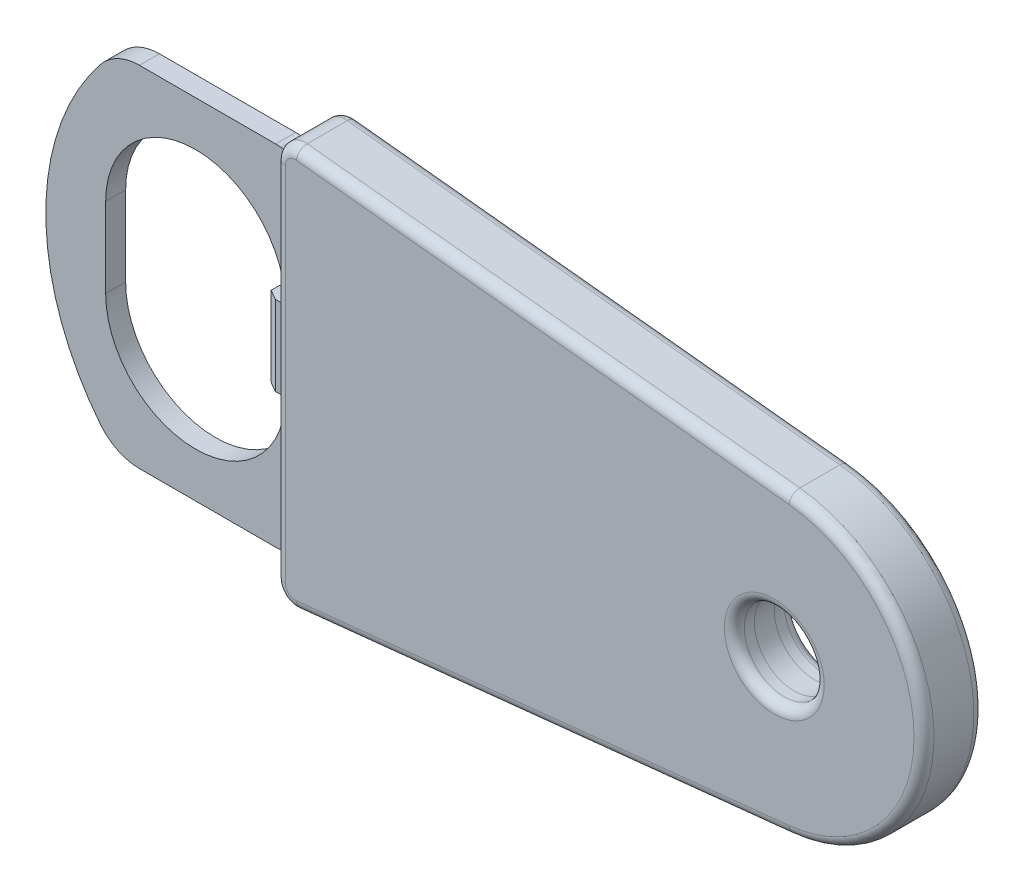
ISO-10303-21;
HEADER;
FILE_DESCRIPTION(('STEP AP214'),'2;1');
FILE_NAME('part.step','',(''),(''),'','','');
FILE_SCHEMA(('AUTOMOTIVE_DESIGN { 1 0 10303 214 1 1 1 1 }'));
ENDSEC;
DATA;
#1=APPLICATION_CONTEXT('core data for automotive mechanical design processes');
#2=APPLICATION_PROTOCOL_DEFINITION('international standard','automotive_design',2000,#1);
#3=PRODUCT_CONTEXT('',#1,'mechanical');
#4=PRODUCT('Part','Part','',(#3));
#5=PRODUCT_RELATED_PRODUCT_CATEGORY('part','',(#4));
#6=PRODUCT_DEFINITION_FORMATION('','',#4);
#7=PRODUCT_DEFINITION_CONTEXT('part definition',#1,'design');
#8=PRODUCT_DEFINITION('design','',#6,#7);
#9=PRODUCT_DEFINITION_SHAPE('','',#8);
#10=(LENGTH_UNIT() NAMED_UNIT(*) SI_UNIT(.MILLI.,.METRE.));
#11=(NAMED_UNIT(*) PLANE_ANGLE_UNIT() SI_UNIT($,.RADIAN.));
#12=(NAMED_UNIT(*) SI_UNIT($,.STERADIAN.) SOLID_ANGLE_UNIT());
#13=UNCERTAINTY_MEASURE_WITH_UNIT(LENGTH_MEASURE(1.E-05),#10,'distance_accuracy_value','');
#14=(GEOMETRIC_REPRESENTATION_CONTEXT(3) GLOBAL_UNCERTAINTY_ASSIGNED_CONTEXT((#13)) GLOBAL_UNIT_ASSIGNED_CONTEXT((#10,
#11,#12)) REPRESENTATION_CONTEXT('',''));
#15=CARTESIAN_POINT('',(0.,0.,0.));
#16=DIRECTION('',(0.,0.,1.));
#17=DIRECTION('',(1.,0.,0.));
#18=AXIS2_PLACEMENT_3D('',#15,#16,#17);
#19=CARTESIAN_POINT('',(-50.,-20.3378359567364,-3.));
#20=DIRECTION('',(-1.,0.,0.));
#21=DIRECTION('',(0.,-1.,0.));
#22=AXIS2_PLACEMENT_3D('',#19,#20,#21);
#23=PLANE('',#22);
#24=DIRECTION('',(0.,0.,1.));
#25=VECTOR('',#24,1.);
#26=CARTESIAN_POINT('',(-50.,18.116610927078,-3.));
#27=LINE('',#26,#25);
#28=CARTESIAN_POINT('',(-50.,18.116610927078,2.));
#29=VERTEX_POINT('',#28);
#30=CARTESIAN_POINT('',(-50.,18.116610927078,-2.));
#31=VERTEX_POINT('',#30);
#32=EDGE_CURVE('E302',#29,#31,#27,.F.);
#33=ORIENTED_EDGE('',*,*,#32,.T.);
#34=DIRECTION('',(0.,-1.,0.));
#35=VECTOR('',#34,1.);
#36=CARTESIAN_POINT('',(-50.,-18.116610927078,-2.));
#37=LINE('',#36,#35);
#38=CARTESIAN_POINT('',(-50.,-18.116610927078,-2.));
#39=VERTEX_POINT('',#38);
#40=EDGE_CURVE('E341',#31,#39,#37,.T.);
#41=ORIENTED_EDGE('',*,*,#40,.T.);
#42=DIRECTION('',(0.,0.,1.));
#43=VECTOR('',#42,1.);
#44=CARTESIAN_POINT('',(-50.,-18.116610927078,-3.));
#45=LINE('',#44,#43);
#46=CARTESIAN_POINT('',(-50.,-18.116610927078,2.));
#47=VERTEX_POINT('',#46);
#48=EDGE_CURVE('E299',#39,#47,#45,.T.);
#49=ORIENTED_EDGE('',*,*,#48,.T.);
#50=DIRECTION('',(0.,-1.,0.));
#51=VECTOR('',#50,1.);
#52=CARTESIAN_POINT('',(-50.,-20.3378359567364,2.));
#53=LINE('',#52,#51);
#54=EDGE_CURVE('E339',#47,#29,#53,.F.);
#55=ORIENTED_EDGE('',*,*,#54,.T.);
#56=EDGE_LOOP('',(#33,#41,#49,#55));
#57=FACE_BOUND('',#56,.T.);
#58=DIRECTION('',(0.,0.,1.));
#59=VECTOR('',#58,1.);
#60=CARTESIAN_POINT('',(-50.,-17.3213111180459,-3.));
#61=LINE('',#60,#59);
#62=CARTESIAN_POINT('',(-50.,-17.3213111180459,-1.));
#63=VERTEX_POINT('',#62);
#64=CARTESIAN_POINT('',(-50.,-17.3213111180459,1.));
#65=VERTEX_POINT('',#64);
#66=EDGE_CURVE('E12',#63,#65,#61,.T.);
#67=ORIENTED_EDGE('',*,*,#66,.F.);
#68=DIRECTION('',(0.,1.,0.));
#69=VECTOR('',#68,1.);
#70=CARTESIAN_POINT('',(-50.,-20.3378359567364,-1.));
#71=LINE('',#70,#69);
#72=CARTESIAN_POINT('',(-50.,17.3213111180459,-1.));
#73=VERTEX_POINT('',#72);
#74=EDGE_CURVE('E285',#63,#73,#71,.T.);
#75=ORIENTED_EDGE('',*,*,#74,.T.);
#76=DIRECTION('',(0.,0.,-1.));
#77=VECTOR('',#76,1.);
#78=CARTESIAN_POINT('',(-50.,17.3213111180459,-3.));
#79=LINE('',#78,#77);
#80=CARTESIAN_POINT('',(-50.,17.3213111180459,1.));
#81=VERTEX_POINT('',#80);
#82=EDGE_CURVE('E56',#81,#73,#79,.T.);
#83=ORIENTED_EDGE('',*,*,#82,.F.);
#84=DIRECTION('',(0.,1.,0.));
#85=VECTOR('',#84,1.);
#86=CARTESIAN_POINT('',(-50.,-20.3378359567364,1.));
#87=LINE('',#86,#85);
#88=EDGE_CURVE('E227',#65,#81,#87,.T.);
#89=ORIENTED_EDGE('',*,*,#88,.F.);
#90=EDGE_LOOP('',(#67,#75,#83,#89));
#91=FACE_BOUND('',#90,.T.);
#92=ADVANCED_FACE('F48',(#57,#91),#23,.T.);
#93=CARTESIAN_POINT('',(0.,0.,-3.));
#94=DIRECTION('',(0.,0.,1.));
#95=DIRECTION('',(1.,0.,0.));
#96=AXIS2_PLACEMENT_3D('',#93,#94,#95);
#97=CYLINDRICAL_SURFACE('',#96,4.);
#98=CARTESIAN_POINT('',(0.,0.,-2.));
#99=DIRECTION('',(0.,0.,1.));
#100=DIRECTION('',(1.,0.,0.));
#101=AXIS2_PLACEMENT_3D('',#98,#99,#100);
#102=CIRCLE('',#101,4.);
#103=CARTESIAN_POINT('',(4.,0.,-2.));
#104=VERTEX_POINT('',#103);
#105=EDGE_CURVE('E314',#104,#104,#102,.F.);
#106=ORIENTED_EDGE('',*,*,#105,.T.);
#107=EDGE_LOOP('',(#106));
#108=FACE_BOUND('',#107,.T.);
#109=CARTESIAN_POINT('',(0.,0.,-1.));
#110=DIRECTION('',(0.,0.,1.));
#111=DIRECTION('',(1.,0.,0.));
#112=AXIS2_PLACEMENT_3D('',#109,#110,#111);
#113=CIRCLE('',#112,4.);
#114=CARTESIAN_POINT('',(4.,0.,-1.));
#115=VERTEX_POINT('',#114);
#116=EDGE_CURVE('E240',#115,#115,#113,.T.);
#117=ORIENTED_EDGE('',*,*,#116,.T.);
#118=EDGE_LOOP('',(#117));
#119=FACE_BOUND('',#118,.T.);
#120=ADVANCED_FACE('F417',(#108,#119),#97,.F.);
#121=CARTESIAN_POINT('',(-50.,20.3378359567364,-3.));
#122=DIRECTION('',(0.10452846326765,0.994521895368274,0.));
#123=DIRECTION('',(-0.994521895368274,0.10452846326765,0.));
#124=AXIS2_PLACEMENT_3D('',#121,#122,#123);
#125=PLANE('',#124);
#126=DIRECTION('',(0.,0.,1.));
#127=VECTOR('',#126,1.);
#128=CARTESIAN_POINT('',(1.56792694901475,14.9178284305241,-3.));
#129=LINE('',#128,#127);
#130=CARTESIAN_POINT('',(1.56792694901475,14.9178284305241,-2.));
#131=VERTEX_POINT('',#130);
#132=CARTESIAN_POINT('',(1.56792694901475,14.9178284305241,2.));
#133=VERTEX_POINT('',#132);
#134=EDGE_CURVE('E289',#131,#133,#129,.T.);
#135=ORIENTED_EDGE('',*,*,#134,.F.);
#136=DIRECTION('',(-0.994521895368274,0.10452846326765,0.));
#137=VECTOR('',#136,1.);
#138=CARTESIAN_POINT('',(-47.7909430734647,20.1056547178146,-2.));
#139=LINE('',#138,#137);
#140=CARTESIAN_POINT('',(-47.7909430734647,20.1056547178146,-2.));
#141=VERTEX_POINT('',#140);
#142=EDGE_CURVE('E349',#131,#141,#139,.T.);
#143=ORIENTED_EDGE('',*,*,#142,.T.);
#144=DIRECTION('',(0.,0.,1.));
#145=VECTOR('',#144,1.);
#146=CARTESIAN_POINT('',(-47.7909430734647,20.1056547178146,-3.));
#147=LINE('',#146,#145);
#148=CARTESIAN_POINT('',(-47.7909430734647,20.1056547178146,2.));
#149=VERTEX_POINT('',#148);
#150=EDGE_CURVE('E292',#141,#149,#147,.T.);
#151=ORIENTED_EDGE('',*,*,#150,.T.);
#152=DIRECTION('',(-0.994521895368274,0.10452846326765,0.));
#153=VECTOR('',#152,1.);
#154=CARTESIAN_POINT('',(-50.,20.3378359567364,2.));
#155=LINE('',#154,#153);
#156=EDGE_CURVE('E347',#149,#133,#155,.F.);
#157=ORIENTED_EDGE('',*,*,#156,.T.);
#158=EDGE_LOOP('',(#135,#143,#151,#157));
#159=FACE_BOUND('',#158,.T.);
#160=ADVANCED_FACE('F423',(#159),#125,.T.);
#161=CARTESIAN_POINT('',(0.,0.,-3.));
#162=DIRECTION('',(0.,0.,1.));
#163=DIRECTION('',(1.,0.,0.));
#164=AXIS2_PLACEMENT_3D('',#161,#162,#163);
#165=CYLINDRICAL_SURFACE('',#164,15.);
#166=DIRECTION('',(0.,0.,1.));
#167=VECTOR('',#166,1.);
#168=CARTESIAN_POINT('',(1.56792694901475,-14.9178284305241,-3.));
#169=LINE('',#168,#167);
#170=CARTESIAN_POINT('',(1.56792694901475,-14.9178284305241,-2.));
#171=VERTEX_POINT('',#170);
#172=CARTESIAN_POINT('',(1.56792694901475,-14.9178284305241,2.));
#173=VERTEX_POINT('',#172);
#174=EDGE_CURVE('E293',#171,#173,#169,.T.);
#175=ORIENTED_EDGE('',*,*,#174,.F.);
#176=CARTESIAN_POINT('',(0.,0.,-2.));
#177=DIRECTION('',(0.,0.,1.));
#178=DIRECTION('',(1.,0.,0.));
#179=AXIS2_PLACEMENT_3D('',#176,#177,#178);
#180=CIRCLE('',#179,15.);
#181=EDGE_CURVE('E353',#171,#131,#180,.T.);
#182=ORIENTED_EDGE('',*,*,#181,.T.);
#183=ORIENTED_EDGE('',*,*,#134,.T.);
#184=CARTESIAN_POINT('',(0.,0.,2.));
#185=DIRECTION('',(0.,0.,1.));
#186=DIRECTION('',(1.,0.,0.));
#187=AXIS2_PLACEMENT_3D('',#184,#185,#186);
#188=CIRCLE('',#187,15.);
#189=EDGE_CURVE('E351',#133,#173,#188,.F.);
#190=ORIENTED_EDGE('',*,*,#189,.T.);
#191=EDGE_LOOP('',(#175,#182,#183,#190));
#192=FACE_BOUND('',#191,.T.);
#193=ADVANCED_FACE('F507',(#192),#165,.T.);
#194=CARTESIAN_POINT('',(1.56792694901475,-14.9178284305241,-3.));
#195=DIRECTION('',(0.10452846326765,-0.994521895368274,0.));
#196=DIRECTION('',(0.994521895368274,0.10452846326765,0.));
#197=AXIS2_PLACEMENT_3D('',#194,#195,#196);
#198=PLANE('',#197);
#199=DIRECTION('',(0.,0.,1.));
#200=VECTOR('',#199,1.);
#201=CARTESIAN_POINT('',(-47.7909430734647,-20.1056547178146,-3.));
#202=LINE('',#201,#200);
#203=CARTESIAN_POINT('',(-47.7909430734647,-20.1056547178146,2.));
#204=VERTEX_POINT('',#203);
#205=CARTESIAN_POINT('',(-47.7909430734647,-20.1056547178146,-2.));
#206=VERTEX_POINT('',#205);
#207=EDGE_CURVE('E305',#204,#206,#202,.F.);
#208=ORIENTED_EDGE('',*,*,#207,.T.);
#209=DIRECTION('',(0.994521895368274,0.10452846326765,0.));
#210=VECTOR('',#209,1.);
#211=CARTESIAN_POINT('',(1.56792694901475,-14.9178284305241,-2.));
#212=LINE('',#211,#210);
#213=EDGE_CURVE('E368',#206,#171,#212,.T.);
#214=ORIENTED_EDGE('',*,*,#213,.T.);
#215=ORIENTED_EDGE('',*,*,#174,.T.);
#216=DIRECTION('',(0.994521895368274,0.10452846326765,0.));
#217=VECTOR('',#216,1.);
#218=CARTESIAN_POINT('',(1.56792694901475,-14.9178284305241,2.));
#219=LINE('',#218,#217);
#220=EDGE_CURVE('E366',#173,#204,#219,.F.);
#221=ORIENTED_EDGE('',*,*,#220,.T.);
#222=EDGE_LOOP('',(#208,#214,#215,#221));
#223=FACE_BOUND('',#222,.T.);
#224=ADVANCED_FACE('F429',(#223),#198,.T.);
#225=CARTESIAN_POINT('',(0.,0.,-3.));
#226=DIRECTION('',(0.,0.,1.));
#227=DIRECTION('',(1.,0.,0.));
#228=AXIS2_PLACEMENT_3D('',#225,#226,#227);
#229=PLANE('',#228);
#230=DIRECTION('',(0.994521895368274,0.10452846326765,0.));
#231=VECTOR('',#230,1.);
#232=CARTESIAN_POINT('',(-47.8954715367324,-19.1111328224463,-3.));
#233=LINE('',#232,#231);
#234=CARTESIAN_POINT('',(1.4633984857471,-13.9233065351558,-3.));
#235=VERTEX_POINT('',#234);
#236=CARTESIAN_POINT('',(-47.8954715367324,-19.1111328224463,-3.));
#237=VERTEX_POINT('',#236);
#238=EDGE_CURVE('E320',#235,#237,#233,.F.);
#239=ORIENTED_EDGE('',*,*,#238,.T.);
#240=CARTESIAN_POINT('',(-48.,-18.116610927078,-3.));
#241=DIRECTION('',(0.,0.,1.));
#242=DIRECTION('',(1.,0.,0.));
#243=AXIS2_PLACEMENT_3D('',#240,#241,#242);
#244=CIRCLE('',#243,1.);
#245=CARTESIAN_POINT('',(-49.,-18.116610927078,-3.));
#246=VERTEX_POINT('',#245);
#247=EDGE_CURVE('E330',#237,#246,#244,.F.);
#248=ORIENTED_EDGE('',*,*,#247,.T.);
#249=DIRECTION('',(0.,-1.,0.));
#250=VECTOR('',#249,1.);
#251=CARTESIAN_POINT('',(-49.,18.116610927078,-3.));
#252=LINE('',#251,#250);
#253=CARTESIAN_POINT('',(-49.,18.116610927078,-3.));
#254=VERTEX_POINT('',#253);
#255=EDGE_CURVE('E328',#246,#254,#252,.F.);
#256=ORIENTED_EDGE('',*,*,#255,.T.);
#257=CARTESIAN_POINT('',(-48.,18.116610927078,-3.));
#258=DIRECTION('',(0.,0.,1.));
#259=DIRECTION('',(1.,0.,0.));
#260=AXIS2_PLACEMENT_3D('',#257,#258,#259);
#261=CIRCLE('',#260,1.);
#262=CARTESIAN_POINT('',(-47.8954715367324,19.1111328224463,-3.));
#263=VERTEX_POINT('',#262);
#264=EDGE_CURVE('E326',#254,#263,#261,.F.);
#265=ORIENTED_EDGE('',*,*,#264,.T.);
#266=DIRECTION('',(-0.994521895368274,0.10452846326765,0.));
#267=VECTOR('',#266,1.);
#268=CARTESIAN_POINT('',(1.46339848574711,13.9233065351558,-3.));
#269=LINE('',#268,#267);
#270=CARTESIAN_POINT('',(1.4633984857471,13.9233065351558,-3.));
#271=VERTEX_POINT('',#270);
#272=EDGE_CURVE('E324',#263,#271,#269,.F.);
#273=ORIENTED_EDGE('',*,*,#272,.T.);
#274=CARTESIAN_POINT('',(0.,0.,-3.));
#275=DIRECTION('',(0.,0.,1.));
#276=DIRECTION('',(1.,0.,0.));
#277=AXIS2_PLACEMENT_3D('',#274,#275,#276);
#278=CIRCLE('',#277,14.);
#279=EDGE_CURVE('E322',#271,#235,#278,.F.);
#280=ORIENTED_EDGE('',*,*,#279,.T.);
#281=EDGE_LOOP('',(#239,#248,#256,#265,#273,#280));
#282=FACE_BOUND('',#281,.T.);
#283=CARTESIAN_POINT('',(0.,0.,-3.));
#284=DIRECTION('',(0.,0.,1.));
#285=DIRECTION('',(1.,0.,0.));
#286=AXIS2_PLACEMENT_3D('',#283,#284,#285);
#287=CIRCLE('',#286,5.);
#288=CARTESIAN_POINT('',(5.,0.,-3.));
#289=VERTEX_POINT('',#288);
#290=EDGE_CURVE('E308',#289,#289,#287,.T.);
#291=ORIENTED_EDGE('',*,*,#290,.T.);
#292=EDGE_LOOP('',(#291));
#293=FACE_BOUND('',#292,.T.);
#294=ADVANCED_FACE('F517',(#282,#293),#229,.F.);
#295=CARTESIAN_POINT('',(0.,0.,1.));
#296=DIRECTION('',(0.,0.,1.));
#297=DIRECTION('',(1.,0.,0.));
#298=AXIS2_PLACEMENT_3D('',#295,#296,#297);
#299=CIRCLE('',#298,4.);
#300=CARTESIAN_POINT('',(4.,0.,1.));
#301=VERTEX_POINT('',#300);
#302=EDGE_CURVE('E232',#301,#301,#299,.T.);
#303=ORIENTED_EDGE('',*,*,#302,.F.);
#304=EDGE_LOOP('',(#303));
#305=FACE_BOUND('',#304,.T.);
#306=CARTESIAN_POINT('',(0.,0.,2.));
#307=DIRECTION('',(0.,0.,1.));
#308=DIRECTION('',(1.,0.,0.));
#309=AXIS2_PLACEMENT_3D('',#306,#307,#308);
#310=CIRCLE('',#309,4.);
#311=CARTESIAN_POINT('',(4.,0.,2.));
#312=VERTEX_POINT('',#311);
#313=EDGE_CURVE('E311',#312,#312,#310,.T.);
#314=ORIENTED_EDGE('',*,*,#313,.T.);
#315=EDGE_LOOP('',(#314));
#316=FACE_BOUND('',#315,.T.);
#317=ADVANCED_FACE('F426',(#305,#316),#97,.F.);
#318=CARTESIAN_POINT('',(0.,0.,3.));
#319=DIRECTION('',(0.,0.,1.));
#320=DIRECTION('',(1.,0.,0.));
#321=AXIS2_PLACEMENT_3D('',#318,#319,#320);
#322=PLANE('',#321);
#323=DIRECTION('',(0.,-1.,0.));
#324=VECTOR('',#323,1.);
#325=CARTESIAN_POINT('',(-49.,0.,3.));
#326=LINE('',#325,#324);
#327=CARTESIAN_POINT('',(-49.,18.116610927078,3.));
#328=VERTEX_POINT('',#327);
#329=CARTESIAN_POINT('',(-49.,-18.116610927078,3.));
#330=VERTEX_POINT('',#329);
#331=EDGE_CURVE('E70',#328,#330,#326,.T.);
#332=ORIENTED_EDGE('',*,*,#331,.T.);
#333=CARTESIAN_POINT('',(-48.,-18.116610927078,3.));
#334=DIRECTION('',(0.,0.,1.));
#335=DIRECTION('',(1.,0.,0.));
#336=AXIS2_PLACEMENT_3D('',#333,#334,#335);
#337=CIRCLE('',#336,1.);
#338=CARTESIAN_POINT('',(-47.8954715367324,-19.1111328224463,3.));
#339=VERTEX_POINT('',#338);
#340=EDGE_CURVE('E364',#330,#339,#337,.T.);
#341=ORIENTED_EDGE('',*,*,#340,.T.);
#342=DIRECTION('',(0.994521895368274,0.10452846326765,0.));
#343=VECTOR('',#342,1.);
#344=CARTESIAN_POINT('',(1.4633984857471,-13.9233065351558,3.));
#345=LINE('',#344,#343);
#346=CARTESIAN_POINT('',(1.4633984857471,-13.9233065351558,3.));
#347=VERTEX_POINT('',#346);
#348=EDGE_CURVE('E355',#339,#347,#345,.T.);
#349=ORIENTED_EDGE('',*,*,#348,.T.);
#350=CARTESIAN_POINT('',(0.,0.,3.));
#351=DIRECTION('',(0.,0.,1.));
#352=DIRECTION('',(1.,0.,0.));
#353=AXIS2_PLACEMENT_3D('',#350,#351,#352);
#354=CIRCLE('',#353,14.);
#355=CARTESIAN_POINT('',(1.4633984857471,13.9233065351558,3.));
#356=VERTEX_POINT('',#355);
#357=EDGE_CURVE('E357',#347,#356,#354,.T.);
#358=ORIENTED_EDGE('',*,*,#357,.T.);
#359=DIRECTION('',(-0.994521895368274,0.10452846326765,0.));
#360=VECTOR('',#359,1.);
#361=CARTESIAN_POINT('',(1.4633984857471,13.9233065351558,3.));
#362=LINE('',#361,#360);
#363=CARTESIAN_POINT('',(-47.8954715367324,19.1111328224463,3.));
#364=VERTEX_POINT('',#363);
#365=EDGE_CURVE('E359',#356,#364,#362,.T.);
#366=ORIENTED_EDGE('',*,*,#365,.T.);
#367=CARTESIAN_POINT('',(-48.,18.116610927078,3.));
#368=DIRECTION('',(0.,0.,1.));
#369=DIRECTION('',(1.,0.,0.));
#370=AXIS2_PLACEMENT_3D('',#367,#368,#369);
#371=CIRCLE('',#370,1.);
#372=EDGE_CURVE('E361',#364,#328,#371,.T.);
#373=ORIENTED_EDGE('',*,*,#372,.T.);
#374=EDGE_LOOP('',(#332,#341,#349,#358,#366,#373));
#375=FACE_BOUND('',#374,.T.);
#376=CARTESIAN_POINT('',(0.,0.,3.));
#377=DIRECTION('',(0.,0.,1.));
#378=DIRECTION('',(1.,0.,0.));
#379=AXIS2_PLACEMENT_3D('',#376,#377,#378);
#380=CIRCLE('',#379,5.);
#381=CARTESIAN_POINT('',(5.,0.,3.));
#382=VERTEX_POINT('',#381);
#383=EDGE_CURVE('E317',#382,#382,#380,.F.);
#384=ORIENTED_EDGE('',*,*,#383,.T.);
#385=EDGE_LOOP('',(#384));
#386=FACE_BOUND('',#385,.T.);
#387=ADVANCED_FACE('F435',(#375,#386),#322,.T.);
#388=CARTESIAN_POINT('',(-48.,18.116610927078,-3.));
#389=DIRECTION('',(0.,0.,1.));
#390=DIRECTION('',(1.,0.,0.));
#391=AXIS2_PLACEMENT_3D('',#388,#389,#390);
#392=CYLINDRICAL_SURFACE('',#391,2.);
#393=ORIENTED_EDGE('',*,*,#150,.F.);
#394=CARTESIAN_POINT('',(-48.,18.116610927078,-2.));
#395=DIRECTION('',(0.,0.,1.));
#396=DIRECTION('',(1.,0.,0.));
#397=AXIS2_PLACEMENT_3D('',#394,#395,#396);
#398=CIRCLE('',#397,2.);
#399=EDGE_CURVE('E345',#141,#31,#398,.T.);
#400=ORIENTED_EDGE('',*,*,#399,.T.);
#401=ORIENTED_EDGE('',*,*,#32,.F.);
#402=CARTESIAN_POINT('',(-48.,18.116610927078,2.));
#403=DIRECTION('',(0.,0.,1.));
#404=DIRECTION('',(1.,0.,0.));
#405=AXIS2_PLACEMENT_3D('',#402,#403,#404);
#406=CIRCLE('',#405,2.);
#407=EDGE_CURVE('E343',#29,#149,#406,.F.);
#408=ORIENTED_EDGE('',*,*,#407,.T.);
#409=EDGE_LOOP('',(#393,#400,#401,#408));
#410=FACE_BOUND('',#409,.T.);
#411=ADVANCED_FACE('F431',(#410),#392,.T.);
#412=CARTESIAN_POINT('',(-48.,-18.116610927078,-3.));
#413=DIRECTION('',(0.,0.,1.));
#414=DIRECTION('',(1.,0.,0.));
#415=AXIS2_PLACEMENT_3D('',#412,#413,#414);
#416=CYLINDRICAL_SURFACE('',#415,2.);
#417=ORIENTED_EDGE('',*,*,#48,.F.);
#418=CARTESIAN_POINT('',(-48.,-18.116610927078,-2.));
#419=DIRECTION('',(0.,0.,1.));
#420=DIRECTION('',(1.,0.,0.));
#421=AXIS2_PLACEMENT_3D('',#418,#419,#420);
#422=CIRCLE('',#421,2.);
#423=EDGE_CURVE('E336',#39,#206,#422,.T.);
#424=ORIENTED_EDGE('',*,*,#423,.T.);
#425=ORIENTED_EDGE('',*,*,#207,.F.);
#426=CARTESIAN_POINT('',(-48.,-18.116610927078,2.));
#427=DIRECTION('',(0.,0.,1.));
#428=DIRECTION('',(1.,0.,0.));
#429=AXIS2_PLACEMENT_3D('',#426,#427,#428);
#430=CIRCLE('',#429,2.);
#431=EDGE_CURVE('E333',#204,#47,#430,.F.);
#432=ORIENTED_EDGE('',*,*,#431,.T.);
#433=EDGE_LOOP('',(#417,#424,#425,#432));
#434=FACE_BOUND('',#433,.T.);
#435=ADVANCED_FACE('F434',(#434),#416,.T.);
#436=CARTESIAN_POINT('',(0.,0.,-2.));
#437=DIRECTION('',(0.,0.,1.));
#438=DIRECTION('',(1.,0.,0.));
#439=AXIS2_PLACEMENT_3D('',#436,#437,#438);
#440=TOROIDAL_SURFACE('',#439,5.,1.);
#441=ORIENTED_EDGE('',*,*,#105,.F.);
#442=EDGE_LOOP('',(#441));
#443=FACE_BOUND('',#442,.T.);
#444=ORIENTED_EDGE('',*,*,#290,.F.);
#445=EDGE_LOOP('',(#444));
#446=FACE_BOUND('',#445,.T.);
#447=ADVANCED_FACE('F439',(#443,#446),#440,.T.);
#448=CARTESIAN_POINT('',(0.,0.,2.));
#449=DIRECTION('',(0.,0.,1.));
#450=DIRECTION('',(1.,0.,0.));
#451=AXIS2_PLACEMENT_3D('',#448,#449,#450);
#452=TOROIDAL_SURFACE('',#451,5.,1.);
#453=ORIENTED_EDGE('',*,*,#383,.F.);
#454=EDGE_LOOP('',(#453));
#455=FACE_BOUND('',#454,.T.);
#456=ORIENTED_EDGE('',*,*,#313,.F.);
#457=EDGE_LOOP('',(#456));
#458=FACE_BOUND('',#457,.T.);
#459=ADVANCED_FACE('F443',(#455,#458),#452,.T.);
#460=CARTESIAN_POINT('',(-50.1045284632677,19.3433140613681,-2.));
#461=DIRECTION('',(0.994521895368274,-0.10452846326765,0.));
#462=DIRECTION('',(0.10452846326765,0.994521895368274,0.));
#463=AXIS2_PLACEMENT_3D('',#460,#461,#462);
#464=CYLINDRICAL_SURFACE('',#463,1.);
#465=CARTESIAN_POINT('',(-47.8954715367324,19.1111328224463,-2.));
#466=DIRECTION('',(-0.994521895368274,0.104528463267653,0.));
#467=DIRECTION('',(-0.104528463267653,-0.994521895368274,0.));
#468=AXIS2_PLACEMENT_3D('',#465,#466,#467);
#469=CIRCLE('',#468,1.);
#470=EDGE_CURVE('E381',#141,#263,#469,.T.);
#471=ORIENTED_EDGE('',*,*,#470,.F.);
#472=ORIENTED_EDGE('',*,*,#142,.F.);
#473=CARTESIAN_POINT('',(1.4633984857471,13.9233065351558,-2.));
#474=DIRECTION('',(0.994521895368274,-0.10452846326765,0.));
#475=DIRECTION('',(0.10452846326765,0.994521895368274,0.));
#476=AXIS2_PLACEMENT_3D('',#473,#474,#475);
#477=CIRCLE('',#476,1.);
#478=EDGE_CURVE('E296',#271,#131,#477,.T.);
#479=ORIENTED_EDGE('',*,*,#478,.F.);
#480=ORIENTED_EDGE('',*,*,#272,.F.);
#481=EDGE_LOOP('',(#471,#472,#479,#480));
#482=FACE_BOUND('',#481,.T.);
#483=ADVANCED_FACE('F447',(#482),#464,.T.);
#484=CARTESIAN_POINT('',(0.,0.,-2.));
#485=DIRECTION('',(0.,0.,1.));
#486=DIRECTION('',(1.,0.,0.));
#487=AXIS2_PLACEMENT_3D('',#484,#485,#486);
#488=TOROIDAL_SURFACE('',#487,14.,1.);
#489=ORIENTED_EDGE('',*,*,#478,.T.);
#490=ORIENTED_EDGE('',*,*,#181,.F.);
#491=CARTESIAN_POINT('',(1.4633984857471,-13.9233065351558,-2.));
#492=DIRECTION('',(-0.994521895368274,-0.10452846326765,0.));
#493=DIRECTION('',(0.10452846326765,-0.994521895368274,0.));
#494=AXIS2_PLACEMENT_3D('',#491,#492,#493);
#495=CIRCLE('',#494,1.);
#496=EDGE_CURVE('E378',#235,#171,#495,.T.);
#497=ORIENTED_EDGE('',*,*,#496,.F.);
#498=ORIENTED_EDGE('',*,*,#279,.F.);
#499=EDGE_LOOP('',(#489,#490,#497,#498));
#500=FACE_BOUND('',#499,.T.);
#501=ADVANCED_FACE('F464',(#500),#488,.T.);
#502=CARTESIAN_POINT('',(-48.,18.116610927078,-2.));
#503=DIRECTION('',(0.,0.,1.));
#504=DIRECTION('',(1.,0.,0.));
#505=AXIS2_PLACEMENT_3D('',#502,#503,#504);
#506=DEGENERATE_TOROIDAL_SURFACE('',#505,1.,1.,.T.);
#507=ORIENTED_EDGE('',*,*,#470,.T.);
#508=ORIENTED_EDGE('',*,*,#264,.F.);
#509=CARTESIAN_POINT('',(-49.,18.116610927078,-2.));
#510=DIRECTION('',(0.,-1.,0.));
#511=DIRECTION('',(0.,0.,-1.));
#512=AXIS2_PLACEMENT_3D('',#509,#510,#511);
#513=CIRCLE('',#512,1.);
#514=EDGE_CURVE('E375',#31,#254,#513,.T.);
#515=ORIENTED_EDGE('',*,*,#514,.F.);
#516=ORIENTED_EDGE('',*,*,#399,.F.);
#517=EDGE_LOOP('',(#507,#508,#515,#516));
#518=FACE_BOUND('',#517,.T.);
#519=ADVANCED_FACE('F460',(#518),#506,.T.);
#520=CARTESIAN_POINT('',(1.4633984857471,-13.9233065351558,-2.));
#521=DIRECTION('',(-0.994521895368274,-0.10452846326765,0.));
#522=DIRECTION('',(0.10452846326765,-0.994521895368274,0.));
#523=AXIS2_PLACEMENT_3D('',#520,#521,#522);
#524=CYLINDRICAL_SURFACE('',#523,1.);
#525=ORIENTED_EDGE('',*,*,#496,.T.);
#526=ORIENTED_EDGE('',*,*,#213,.F.);
#527=CARTESIAN_POINT('',(-47.8954715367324,-19.1111328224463,-2.));
#528=DIRECTION('',(-0.994521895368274,-0.104528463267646,0.));
#529=DIRECTION('',(0.104528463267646,-0.994521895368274,0.));
#530=AXIS2_PLACEMENT_3D('',#527,#528,#529);
#531=CIRCLE('',#530,1.);
#532=EDGE_CURVE('E372',#237,#206,#531,.T.);
#533=ORIENTED_EDGE('',*,*,#532,.F.);
#534=ORIENTED_EDGE('',*,*,#238,.F.);
#535=EDGE_LOOP('',(#525,#526,#533,#534));
#536=FACE_BOUND('',#535,.T.);
#537=ADVANCED_FACE('F456',(#536),#524,.T.);
#538=CARTESIAN_POINT('',(-49.,-20.3378359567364,-2.));
#539=DIRECTION('',(0.,1.,0.));
#540=DIRECTION('',(-1.,0.,0.));
#541=AXIS2_PLACEMENT_3D('',#538,#539,#540);
#542=CYLINDRICAL_SURFACE('',#541,1.);
#543=ORIENTED_EDGE('',*,*,#514,.T.);
#544=ORIENTED_EDGE('',*,*,#255,.F.);
#545=CARTESIAN_POINT('',(-49.,-18.116610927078,-2.));
#546=DIRECTION('',(0.,-1.,0.));
#547=DIRECTION('',(0.,0.,-1.));
#548=AXIS2_PLACEMENT_3D('',#545,#546,#547);
#549=CIRCLE('',#548,1.);
#550=EDGE_CURVE('E370',#39,#246,#549,.T.);
#551=ORIENTED_EDGE('',*,*,#550,.F.);
#552=ORIENTED_EDGE('',*,*,#40,.F.);
#553=EDGE_LOOP('',(#543,#544,#551,#552));
#554=FACE_BOUND('',#553,.T.);
#555=ADVANCED_FACE('F452',(#554),#542,.T.);
#556=CARTESIAN_POINT('',(-48.,-18.116610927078,-2.));
#557=DIRECTION('',(0.,0.,1.));
#558=DIRECTION('',(1.,0.,0.));
#559=AXIS2_PLACEMENT_3D('',#556,#557,#558);
#560=DEGENERATE_TOROIDAL_SURFACE('',#559,1.,1.,.T.);
#561=ORIENTED_EDGE('',*,*,#532,.T.);
#562=ORIENTED_EDGE('',*,*,#423,.F.);
#563=ORIENTED_EDGE('',*,*,#550,.T.);
#564=ORIENTED_EDGE('',*,*,#247,.F.);
#565=EDGE_LOOP('',(#561,#562,#563,#564));
#566=FACE_BOUND('',#565,.T.);
#567=ADVANCED_FACE('F449',(#566),#560,.T.);
#568=CARTESIAN_POINT('',(1.4633984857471,13.9233065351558,2.));
#569=DIRECTION('',(-0.994521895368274,0.10452846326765,0.));
#570=DIRECTION('',(-0.10452846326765,-0.994521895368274,0.));
#571=AXIS2_PLACEMENT_3D('',#568,#569,#570);
#572=CYLINDRICAL_SURFACE('',#571,1.);
#573=CARTESIAN_POINT('',(1.4633984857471,13.9233065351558,2.));
#574=DIRECTION('',(0.994521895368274,-0.10452846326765,0.));
#575=DIRECTION('',(0.10452846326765,0.994521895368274,0.));
#576=AXIS2_PLACEMENT_3D('',#573,#574,#575);
#577=CIRCLE('',#576,1.);
#578=EDGE_CURVE('E395',#133,#356,#577,.T.);
#579=ORIENTED_EDGE('',*,*,#578,.F.);
#580=ORIENTED_EDGE('',*,*,#156,.F.);
#581=CARTESIAN_POINT('',(-47.8954715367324,19.1111328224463,2.));
#582=DIRECTION('',(-0.994521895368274,0.104528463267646,0.));
#583=DIRECTION('',(-0.104528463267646,-0.994521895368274,0.));
#584=AXIS2_PLACEMENT_3D('',#581,#582,#583);
#585=CIRCLE('',#584,1.);
#586=EDGE_CURVE('E373',#364,#149,#585,.T.);
#587=ORIENTED_EDGE('',*,*,#586,.F.);
#588=ORIENTED_EDGE('',*,*,#365,.F.);
#589=EDGE_LOOP('',(#579,#580,#587,#588));
#590=FACE_BOUND('',#589,.T.);
#591=ADVANCED_FACE('F50',(#590),#572,.T.);
#592=CARTESIAN_POINT('',(-48.,18.116610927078,2.));
#593=DIRECTION('',(0.,0.,1.));
#594=DIRECTION('',(1.,0.,0.));
#595=AXIS2_PLACEMENT_3D('',#592,#593,#594);
#596=DEGENERATE_TOROIDAL_SURFACE('',#595,1.,1.,.T.);
#597=ORIENTED_EDGE('',*,*,#586,.T.);
#598=ORIENTED_EDGE('',*,*,#407,.F.);
#599=CARTESIAN_POINT('',(-49.,18.116610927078,2.));
#600=DIRECTION('',(0.,-1.,0.));
#601=DIRECTION('',(0.,0.,-1.));
#602=AXIS2_PLACEMENT_3D('',#599,#600,#601);
#603=CIRCLE('',#602,1.);
#604=EDGE_CURVE('E392',#328,#29,#603,.T.);
#605=ORIENTED_EDGE('',*,*,#604,.F.);
#606=ORIENTED_EDGE('',*,*,#372,.F.);
#607=EDGE_LOOP('',(#597,#598,#605,#606));
#608=FACE_BOUND('',#607,.T.);
#609=ADVANCED_FACE('F485',(#608),#596,.T.);
#610=CARTESIAN_POINT('',(0.,0.,2.));
#611=DIRECTION('',(0.,0.,1.));
#612=DIRECTION('',(1.,0.,0.));
#613=AXIS2_PLACEMENT_3D('',#610,#611,#612);
#614=TOROIDAL_SURFACE('',#613,14.,1.);
#615=ORIENTED_EDGE('',*,*,#578,.T.);
#616=ORIENTED_EDGE('',*,*,#357,.F.);
#617=CARTESIAN_POINT('',(1.4633984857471,-13.9233065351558,2.));
#618=DIRECTION('',(-0.994521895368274,-0.10452846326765,0.));
#619=DIRECTION('',(0.10452846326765,-0.994521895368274,0.));
#620=AXIS2_PLACEMENT_3D('',#617,#618,#619);
#621=CIRCLE('',#620,1.);
#622=EDGE_CURVE('E389',#173,#347,#621,.T.);
#623=ORIENTED_EDGE('',*,*,#622,.F.);
#624=ORIENTED_EDGE('',*,*,#189,.F.);
#625=EDGE_LOOP('',(#615,#616,#623,#624));
#626=FACE_BOUND('',#625,.T.);
#627=ADVANCED_FACE('F482',(#626),#614,.T.);
#628=CARTESIAN_POINT('',(-49.,0.,2.));
#629=DIRECTION('',(0.,-1.,0.));
#630=DIRECTION('',(1.,0.,0.));
#631=AXIS2_PLACEMENT_3D('',#628,#629,#630);
#632=CYLINDRICAL_SURFACE('',#631,1.);
#633=ORIENTED_EDGE('',*,*,#604,.T.);
#634=ORIENTED_EDGE('',*,*,#54,.F.);
#635=CARTESIAN_POINT('',(-49.,-18.116610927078,2.));
#636=DIRECTION('',(0.,-1.,0.));
#637=DIRECTION('',(0.,0.,-1.));
#638=AXIS2_PLACEMENT_3D('',#635,#636,#637);
#639=CIRCLE('',#638,1.);
#640=EDGE_CURVE('E387',#330,#47,#639,.T.);
#641=ORIENTED_EDGE('',*,*,#640,.F.);
#642=ORIENTED_EDGE('',*,*,#331,.F.);
#643=EDGE_LOOP('',(#633,#634,#641,#642));
#644=FACE_BOUND('',#643,.T.);
#645=ADVANCED_FACE('F478',(#644),#632,.T.);
#646=CARTESIAN_POINT('',(1.4633984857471,-13.9233065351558,2.));
#647=DIRECTION('',(0.994521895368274,0.10452846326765,0.));
#648=DIRECTION('',(-0.10452846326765,0.994521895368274,0.));
#649=AXIS2_PLACEMENT_3D('',#646,#647,#648);
#650=CYLINDRICAL_SURFACE('',#649,1.);
#651=ORIENTED_EDGE('',*,*,#622,.T.);
#652=ORIENTED_EDGE('',*,*,#348,.F.);
#653=CARTESIAN_POINT('',(-47.8954715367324,-19.1111328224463,2.));
#654=DIRECTION('',(-0.994521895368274,-0.104528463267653,0.));
#655=DIRECTION('',(0.104528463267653,-0.994521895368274,0.));
#656=AXIS2_PLACEMENT_3D('',#653,#654,#655);
#657=CIRCLE('',#656,1.);
#658=EDGE_CURVE('E288',#204,#339,#657,.T.);
#659=ORIENTED_EDGE('',*,*,#658,.F.);
#660=ORIENTED_EDGE('',*,*,#220,.F.);
#661=EDGE_LOOP('',(#651,#652,#659,#660));
#662=FACE_BOUND('',#661,.T.);
#663=ADVANCED_FACE('F474',(#662),#650,.T.);
#664=CARTESIAN_POINT('',(-48.,-18.116610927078,2.));
#665=DIRECTION('',(0.,0.,1.));
#666=DIRECTION('',(1.,0.,0.));
#667=AXIS2_PLACEMENT_3D('',#664,#665,#666);
#668=DEGENERATE_TOROIDAL_SURFACE('',#667,1.,1.,.T.);
#669=ORIENTED_EDGE('',*,*,#640,.T.);
#670=ORIENTED_EDGE('',*,*,#431,.F.);
#671=ORIENTED_EDGE('',*,*,#658,.T.);
#672=ORIENTED_EDGE('',*,*,#340,.F.);
#673=EDGE_LOOP('',(#669,#670,#671,#672));
#674=FACE_BOUND('',#673,.T.);
#675=ADVANCED_FACE('F413',(#674),#668,.T.);
#676=CARTESIAN_POINT('',(0.,0.,-1.));
#677=DIRECTION('',(0.,0.,1.));
#678=DIRECTION('',(1.,0.,0.));
#679=AXIS2_PLACEMENT_3D('',#676,#677,#678);
#680=CYLINDRICAL_SURFACE('',#679,12.);
#681=DIRECTION('',(0.,0.,1.));
#682=VECTOR('',#681,1.);
#683=CARTESIAN_POINT('',(1.25434155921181,11.9342627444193,-1.));
#684=LINE('',#683,#682);
#685=CARTESIAN_POINT('',(1.25434155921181,11.9342627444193,-1.));
#686=VERTEX_POINT('',#685);
#687=CARTESIAN_POINT('',(1.25434155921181,11.9342627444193,1.));
#688=VERTEX_POINT('',#687);
#689=EDGE_CURVE('E209',#686,#688,#684,.T.);
#690=ORIENTED_EDGE('',*,*,#689,.F.);
#691=CARTESIAN_POINT('',(0.,0.,-1.));
#692=DIRECTION('',(0.,0.,1.));
#693=DIRECTION('',(1.,0.,0.));
#694=AXIS2_PLACEMENT_3D('',#691,#692,#693);
#695=CIRCLE('',#694,12.);
#696=CARTESIAN_POINT('',(1.25434155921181,-11.9342627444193,-1.));
#697=VERTEX_POINT('',#696);
#698=EDGE_CURVE('E243',#697,#686,#695,.T.);
#699=ORIENTED_EDGE('',*,*,#698,.F.);
#700=DIRECTION('',(0.,0.,1.));
#701=VECTOR('',#700,1.);
#702=CARTESIAN_POINT('',(1.25434155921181,-11.9342627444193,-1.));
#703=LINE('',#702,#701);
#704=CARTESIAN_POINT('',(1.25434155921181,-11.9342627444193,1.));
#705=VERTEX_POINT('',#704);
#706=EDGE_CURVE('E220',#697,#705,#703,.T.);
#707=ORIENTED_EDGE('',*,*,#706,.T.);
#708=CARTESIAN_POINT('',(0.,0.,1.));
#709=DIRECTION('',(0.,0.,1.));
#710=DIRECTION('',(1.,0.,0.));
#711=AXIS2_PLACEMENT_3D('',#708,#709,#710);
#712=CIRCLE('',#711,12.);
#713=EDGE_CURVE('E225',#705,#688,#712,.T.);
#714=ORIENTED_EDGE('',*,*,#713,.T.);
#715=EDGE_LOOP('',(#690,#699,#707,#714));
#716=FACE_BOUND('',#715,.T.);
#717=ADVANCED_FACE('F230',(#716),#680,.F.);
#718=CARTESIAN_POINT('',(-51.7001111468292,-17.5,-1.));
#719=DIRECTION('',(0.104528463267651,-0.994521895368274,0.));
#720=DIRECTION('',(0.994521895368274,0.104528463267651,0.));
#721=AXIS2_PLACEMENT_3D('',#718,#719,#720);
#722=PLANE('',#721);
#723=ORIENTED_EDGE('',*,*,#66,.T.);
#724=DIRECTION('',(0.994521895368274,0.104528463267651,0.));
#725=VECTOR('',#724,1.);
#726=CARTESIAN_POINT('',(-51.7001111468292,-17.5,1.));
#727=LINE('',#726,#725);
#728=EDGE_CURVE('E63',#65,#705,#727,.T.);
#729=ORIENTED_EDGE('',*,*,#728,.T.);
#730=ORIENTED_EDGE('',*,*,#706,.F.);
#731=DIRECTION('',(0.994521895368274,0.104528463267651,0.));
#732=VECTOR('',#731,1.);
#733=CARTESIAN_POINT('',(-51.7001111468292,-17.5,-1.));
#734=LINE('',#733,#732);
#735=EDGE_CURVE('E221',#63,#697,#734,.T.);
#736=ORIENTED_EDGE('',*,*,#735,.F.);
#737=EDGE_LOOP('',(#723,#729,#730,#736));
#738=FACE_BOUND('',#737,.T.);
#739=ADVANCED_FACE('F405',(#738),#722,.F.);
#740=CARTESIAN_POINT('',(1.25434155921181,11.9342627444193,-1.));
#741=DIRECTION('',(0.104528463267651,0.994521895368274,0.));
#742=DIRECTION('',(-0.994521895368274,0.104528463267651,0.));
#743=AXIS2_PLACEMENT_3D('',#740,#741,#742);
#744=PLANE('',#743);
#745=ORIENTED_EDGE('',*,*,#82,.T.);
#746=DIRECTION('',(-0.994521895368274,0.104528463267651,0.));
#747=VECTOR('',#746,1.);
#748=CARTESIAN_POINT('',(1.25434155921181,11.9342627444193,-1.));
#749=LINE('',#748,#747);
#750=EDGE_CURVE('E215',#686,#73,#749,.T.);
#751=ORIENTED_EDGE('',*,*,#750,.F.);
#752=ORIENTED_EDGE('',*,*,#689,.T.);
#753=DIRECTION('',(-0.994521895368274,0.104528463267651,0.));
#754=VECTOR('',#753,1.);
#755=CARTESIAN_POINT('',(1.25434155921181,11.9342627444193,1.));
#756=LINE('',#755,#754);
#757=EDGE_CURVE('E212',#688,#81,#756,.T.);
#758=ORIENTED_EDGE('',*,*,#757,.T.);
#759=EDGE_LOOP('',(#745,#751,#752,#758));
#760=FACE_BOUND('',#759,.T.);
#761=ADVANCED_FACE('F211',(#760),#744,.F.);
#762=CARTESIAN_POINT('',(0.,0.,-1.));
#763=DIRECTION('',(0.,0.,1.));
#764=DIRECTION('',(1.,0.,0.));
#765=AXIS2_PLACEMENT_3D('',#762,#763,#764);
#766=PLANE('',#765);
#767=DIRECTION('',(1.,0.,0.));
#768=VECTOR('',#767,1.);
#769=CARTESIAN_POINT('',(-38.,7.5,-1.));
#770=LINE('',#769,#768);
#771=CARTESIAN_POINT('',(-37.,7.5,-1.));
#772=VERTEX_POINT('',#771);
#773=CARTESIAN_POINT('',(-36.,7.5,-1.));
#774=VERTEX_POINT('',#773);
#775=EDGE_CURVE('E720',#772,#774,#770,.T.);
#776=ORIENTED_EDGE('',*,*,#775,.T.);
#777=CARTESIAN_POINT('',(-36.,6.5,-1.));
#778=DIRECTION('',(0.,0.,1.));
#779=DIRECTION('',(1.,0.,0.));
#780=AXIS2_PLACEMENT_3D('',#777,#778,#779);
#781=CIRCLE('',#780,1.);
#782=CARTESIAN_POINT('',(-35.,6.5,-1.));
#783=VERTEX_POINT('',#782);
#784=EDGE_CURVE('E282',#783,#774,#781,.T.);
#785=ORIENTED_EDGE('',*,*,#784,.F.);
#786=DIRECTION('',(0.,-1.,0.));
#787=VECTOR('',#786,1.);
#788=CARTESIAN_POINT('',(-35.,-7.5,-1.));
#789=LINE('',#788,#787);
#790=CARTESIAN_POINT('',(-35.,-6.5,-1.));
#791=VERTEX_POINT('',#790);
#792=EDGE_CURVE('E725',#783,#791,#789,.T.);
#793=ORIENTED_EDGE('',*,*,#792,.T.);
#794=CARTESIAN_POINT('',(-36.,-6.5,-1.));
#795=DIRECTION('',(0.,0.,1.));
#796=DIRECTION('',(1.,0.,0.));
#797=AXIS2_PLACEMENT_3D('',#794,#795,#796);
#798=CIRCLE('',#797,1.);
#799=CARTESIAN_POINT('',(-36.,-7.5,-1.));
#800=VERTEX_POINT('',#799);
#801=EDGE_CURVE('E278',#800,#791,#798,.T.);
#802=ORIENTED_EDGE('',*,*,#801,.F.);
#803=DIRECTION('',(-1.,0.,0.));
#804=VECTOR('',#803,1.);
#805=CARTESIAN_POINT('',(-38.,-7.5,-1.));
#806=LINE('',#805,#804);
#807=CARTESIAN_POINT('',(-37.,-7.5,-1.));
#808=VERTEX_POINT('',#807);
#809=EDGE_CURVE('E235',#800,#808,#806,.T.);
#810=ORIENTED_EDGE('',*,*,#809,.T.);
#811=CARTESIAN_POINT('',(-37.,-6.5,-1.));
#812=DIRECTION('',(0.,0.,1.));
#813=DIRECTION('',(1.,0.,0.));
#814=AXIS2_PLACEMENT_3D('',#811,#812,#813);
#815=CIRCLE('',#814,1.);
#816=CARTESIAN_POINT('',(-38.,-6.5,-1.));
#817=VERTEX_POINT('',#816);
#818=EDGE_CURVE('E274',#817,#808,#815,.T.);
#819=ORIENTED_EDGE('',*,*,#818,.F.);
#820=DIRECTION('',(0.,1.,0.));
#821=VECTOR('',#820,1.);
#822=CARTESIAN_POINT('',(-38.,-7.5,-1.));
#823=LINE('',#822,#821);
#824=CARTESIAN_POINT('',(-38.,6.5,-1.));
#825=VERTEX_POINT('',#824);
#826=EDGE_CURVE('E724',#817,#825,#823,.T.);
#827=ORIENTED_EDGE('',*,*,#826,.T.);
#828=CARTESIAN_POINT('',(-37.,6.5,-1.));
#829=DIRECTION('',(0.,0.,1.));
#830=DIRECTION('',(1.,0.,0.));
#831=AXIS2_PLACEMENT_3D('',#828,#829,#830);
#832=CIRCLE('',#831,1.);
#833=EDGE_CURVE('E270',#772,#825,#832,.T.);
#834=ORIENTED_EDGE('',*,*,#833,.F.);
#835=EDGE_LOOP('',(#776,#785,#793,#802,#810,#819,#827,#834));
#836=FACE_BOUND('',#835,.T.);
#837=ORIENTED_EDGE('',*,*,#116,.F.);
#838=EDGE_LOOP('',(#837));
#839=FACE_BOUND('',#838,.T.);
#840=ORIENTED_EDGE('',*,*,#735,.T.);
#841=ORIENTED_EDGE('',*,*,#698,.T.);
#842=ORIENTED_EDGE('',*,*,#750,.T.);
#843=ORIENTED_EDGE('',*,*,#74,.F.);
#844=EDGE_LOOP('',(#840,#841,#842,#843));
#845=FACE_BOUND('',#844,.T.);
#846=ADVANCED_FACE('F401',(#836,#839,#845),#766,.T.);
#847=CARTESIAN_POINT('',(0.,0.,1.));
#848=DIRECTION('',(0.,0.,1.));
#849=DIRECTION('',(1.,0.,0.));
#850=AXIS2_PLACEMENT_3D('',#847,#848,#849);
#851=PLANE('',#850);
#852=ORIENTED_EDGE('',*,*,#88,.T.);
#853=ORIENTED_EDGE('',*,*,#757,.F.);
#854=ORIENTED_EDGE('',*,*,#713,.F.);
#855=ORIENTED_EDGE('',*,*,#728,.F.);
#856=EDGE_LOOP('',(#852,#853,#854,#855));
#857=FACE_BOUND('',#856,.T.);
#858=DIRECTION('',(0.,-1.,0.));
#859=VECTOR('',#858,1.);
#860=CARTESIAN_POINT('',(-38.,-7.5,1.));
#861=LINE('',#860,#859);
#862=CARTESIAN_POINT('',(-38.,6.5,1.));
#863=VERTEX_POINT('',#862);
#864=CARTESIAN_POINT('',(-38.,-6.5,1.));
#865=VERTEX_POINT('',#864);
#866=EDGE_CURVE('E729',#863,#865,#861,.T.);
#867=ORIENTED_EDGE('',*,*,#866,.T.);
#868=CARTESIAN_POINT('',(-37.,-6.5,1.));
#869=DIRECTION('',(0.,0.,1.));
#870=DIRECTION('',(1.,0.,0.));
#871=AXIS2_PLACEMENT_3D('',#868,#869,#870);
#872=CIRCLE('',#871,1.);
#873=CARTESIAN_POINT('',(-37.,-7.5,1.));
#874=VERTEX_POINT('',#873);
#875=EDGE_CURVE('E272',#874,#865,#872,.F.);
#876=ORIENTED_EDGE('',*,*,#875,.F.);
#877=DIRECTION('',(1.,0.,0.));
#878=VECTOR('',#877,1.);
#879=CARTESIAN_POINT('',(-38.,-7.5,1.));
#880=LINE('',#879,#878);
#881=CARTESIAN_POINT('',(-36.,-7.5,1.));
#882=VERTEX_POINT('',#881);
#883=EDGE_CURVE('E732',#874,#882,#880,.T.);
#884=ORIENTED_EDGE('',*,*,#883,.T.);
#885=CARTESIAN_POINT('',(-36.,-6.5,1.));
#886=DIRECTION('',(0.,0.,1.));
#887=DIRECTION('',(1.,0.,0.));
#888=AXIS2_PLACEMENT_3D('',#885,#886,#887);
#889=CIRCLE('',#888,1.);
#890=CARTESIAN_POINT('',(-35.,-6.5,1.));
#891=VERTEX_POINT('',#890);
#892=EDGE_CURVE('E276',#891,#882,#889,.F.);
#893=ORIENTED_EDGE('',*,*,#892,.F.);
#894=DIRECTION('',(0.,1.,0.));
#895=VECTOR('',#894,1.);
#896=CARTESIAN_POINT('',(-35.,-7.5,1.));
#897=LINE('',#896,#895);
#898=CARTESIAN_POINT('',(-35.,6.5,1.));
#899=VERTEX_POINT('',#898);
#900=EDGE_CURVE('E736',#891,#899,#897,.T.);
#901=ORIENTED_EDGE('',*,*,#900,.T.);
#902=CARTESIAN_POINT('',(-36.,6.5,1.));
#903=DIRECTION('',(0.,0.,1.));
#904=DIRECTION('',(1.,0.,0.));
#905=AXIS2_PLACEMENT_3D('',#902,#903,#904);
#906=CIRCLE('',#905,1.);
#907=CARTESIAN_POINT('',(-36.,7.5,1.));
#908=VERTEX_POINT('',#907);
#909=EDGE_CURVE('E280',#908,#899,#906,.F.);
#910=ORIENTED_EDGE('',*,*,#909,.F.);
#911=DIRECTION('',(-1.,0.,0.));
#912=VECTOR('',#911,1.);
#913=CARTESIAN_POINT('',(-38.,7.5,1.));
#914=LINE('',#913,#912);
#915=CARTESIAN_POINT('',(-37.,7.5,1.));
#916=VERTEX_POINT('',#915);
#917=EDGE_CURVE('E728',#908,#916,#914,.T.);
#918=ORIENTED_EDGE('',*,*,#917,.T.);
#919=CARTESIAN_POINT('',(-37.,6.5,1.));
#920=DIRECTION('',(0.,0.,1.));
#921=DIRECTION('',(1.,0.,0.));
#922=AXIS2_PLACEMENT_3D('',#919,#920,#921);
#923=CIRCLE('',#922,1.);
#924=EDGE_CURVE('E268',#863,#916,#923,.F.);
#925=ORIENTED_EDGE('',*,*,#924,.F.);
#926=EDGE_LOOP('',(#867,#876,#884,#893,#901,#910,#918,#925));
#927=FACE_BOUND('',#926,.T.);
#928=ORIENTED_EDGE('',*,*,#302,.T.);
#929=EDGE_LOOP('',(#928));
#930=FACE_BOUND('',#929,.T.);
#931=ADVANCED_FACE('F223',(#857,#927,#930),#851,.F.);
#932=CARTESIAN_POINT('',(-38.,-7.5,-32.6227766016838));
#933=DIRECTION('',(-1.,0.,0.));
#934=DIRECTION('',(0.,0.,1.));
#935=AXIS2_PLACEMENT_3D('',#932,#933,#934);
#936=PLANE('',#935);
#937=ORIENTED_EDGE('',*,*,#826,.F.);
#938=DIRECTION('',(0.,0.,1.));
#939=VECTOR('',#938,1.);
#940=CARTESIAN_POINT('',(-38.,-6.5,-1.));
#941=LINE('',#940,#939);
#942=EDGE_CURVE('E247',#865,#817,#941,.F.);
#943=ORIENTED_EDGE('',*,*,#942,.F.);
#944=ORIENTED_EDGE('',*,*,#866,.F.);
#945=DIRECTION('',(0.,0.,1.));
#946=VECTOR('',#945,1.);
#947=CARTESIAN_POINT('',(-38.,6.5,1.));
#948=LINE('',#947,#946);
#949=EDGE_CURVE('E250',#825,#863,#948,.T.);
#950=ORIENTED_EDGE('',*,*,#949,.F.);
#951=EDGE_LOOP('',(#937,#943,#944,#950));
#952=FACE_BOUND('',#951,.T.);
#953=ADVANCED_FACE('F619',(#952),#936,.T.);
#954=CARTESIAN_POINT('',(-38.,7.5,-32.6227766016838));
#955=DIRECTION('',(0.,1.,0.));
#956=DIRECTION('',(-1.,0.,0.));
#957=AXIS2_PLACEMENT_3D('',#954,#955,#956);
#958=PLANE('',#957);
#959=ORIENTED_EDGE('',*,*,#917,.F.);
#960=DIRECTION('',(0.,0.,1.));
#961=VECTOR('',#960,1.);
#962=CARTESIAN_POINT('',(-36.,7.5,1.));
#963=LINE('',#962,#961);
#964=EDGE_CURVE('E253',#774,#908,#963,.T.);
#965=ORIENTED_EDGE('',*,*,#964,.F.);
#966=ORIENTED_EDGE('',*,*,#775,.F.);
#967=DIRECTION('',(0.,0.,1.));
#968=VECTOR('',#967,1.);
#969=CARTESIAN_POINT('',(-37.,7.5,-1.));
#970=LINE('',#969,#968);
#971=EDGE_CURVE('E256',#916,#772,#970,.F.);
#972=ORIENTED_EDGE('',*,*,#971,.F.);
#973=EDGE_LOOP('',(#959,#965,#966,#972));
#974=FACE_BOUND('',#973,.T.);
#975=ADVANCED_FACE('F628',(#974),#958,.T.);
#976=CARTESIAN_POINT('',(-35.,-7.5,-32.6227766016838));
#977=DIRECTION('',(1.,0.,0.));
#978=DIRECTION('',(0.,1.,0.));
#979=AXIS2_PLACEMENT_3D('',#976,#977,#978);
#980=PLANE('',#979);
#981=ORIENTED_EDGE('',*,*,#792,.F.);
#982=DIRECTION('',(0.,0.,1.));
#983=VECTOR('',#982,1.);
#984=CARTESIAN_POINT('',(-35.,6.5,-1.));
#985=LINE('',#984,#983);
#986=EDGE_CURVE('E263',#899,#783,#985,.F.);
#987=ORIENTED_EDGE('',*,*,#986,.F.);
#988=ORIENTED_EDGE('',*,*,#900,.F.);
#989=DIRECTION('',(0.,0.,1.));
#990=VECTOR('',#989,1.);
#991=CARTESIAN_POINT('',(-35.,-6.5,1.));
#992=LINE('',#991,#990);
#993=EDGE_CURVE('E265',#791,#891,#992,.T.);
#994=ORIENTED_EDGE('',*,*,#993,.F.);
#995=EDGE_LOOP('',(#981,#987,#988,#994));
#996=FACE_BOUND('',#995,.T.);
#997=ADVANCED_FACE('F638',(#996),#980,.T.);
#998=CARTESIAN_POINT('',(-38.,-7.5,-32.6227766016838));
#999=DIRECTION('',(0.,-1.,0.));
#1000=DIRECTION('',(1.,0.,0.));
#1001=AXIS2_PLACEMENT_3D('',#998,#999,#1000);
#1002=PLANE('',#1001);
#1003=ORIENTED_EDGE('',*,*,#809,.F.);
#1004=DIRECTION('',(0.,0.,1.));
#1005=VECTOR('',#1004,1.);
#1006=CARTESIAN_POINT('',(-36.,-7.5,-1.));
#1007=LINE('',#1006,#1005);
#1008=EDGE_CURVE('E258',#882,#800,#1007,.F.);
#1009=ORIENTED_EDGE('',*,*,#1008,.F.);
#1010=ORIENTED_EDGE('',*,*,#883,.F.);
#1011=DIRECTION('',(0.,0.,1.));
#1012=VECTOR('',#1011,1.);
#1013=CARTESIAN_POINT('',(-37.,-7.5,1.));
#1014=LINE('',#1013,#1012);
#1015=EDGE_CURVE('E260',#808,#874,#1014,.T.);
#1016=ORIENTED_EDGE('',*,*,#1015,.F.);
#1017=EDGE_LOOP('',(#1003,#1009,#1010,#1016));
#1018=FACE_BOUND('',#1017,.T.);
#1019=ADVANCED_FACE('F648',(#1018),#1002,.T.);
#1020=CARTESIAN_POINT('',(-37.,6.5,-32.6227766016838));
#1021=DIRECTION('',(0.,0.,-1.));
#1022=DIRECTION('',(-1.,0.,0.));
#1023=AXIS2_PLACEMENT_3D('',#1020,#1021,#1022);
#1024=CYLINDRICAL_SURFACE('',#1023,1.);
#1025=ORIENTED_EDGE('',*,*,#833,.T.);
#1026=ORIENTED_EDGE('',*,*,#949,.T.);
#1027=ORIENTED_EDGE('',*,*,#924,.T.);
#1028=ORIENTED_EDGE('',*,*,#971,.T.);
#1029=EDGE_LOOP('',(#1025,#1026,#1027,#1028));
#1030=FACE_BOUND('',#1029,.T.);
#1031=ADVANCED_FACE('F658',(#1030),#1024,.T.);
#1032=CARTESIAN_POINT('',(-37.,-6.5,-32.6227766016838));
#1033=DIRECTION('',(0.,0.,-1.));
#1034=DIRECTION('',(-1.,0.,0.));
#1035=AXIS2_PLACEMENT_3D('',#1032,#1033,#1034);
#1036=CYLINDRICAL_SURFACE('',#1035,1.);
#1037=ORIENTED_EDGE('',*,*,#818,.T.);
#1038=ORIENTED_EDGE('',*,*,#1015,.T.);
#1039=ORIENTED_EDGE('',*,*,#875,.T.);
#1040=ORIENTED_EDGE('',*,*,#942,.T.);
#1041=EDGE_LOOP('',(#1037,#1038,#1039,#1040));
#1042=FACE_BOUND('',#1041,.T.);
#1043=ADVANCED_FACE('F668',(#1042),#1036,.T.);
#1044=CARTESIAN_POINT('',(-36.,-6.5,-32.6227766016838));
#1045=DIRECTION('',(0.,0.,-1.));
#1046=DIRECTION('',(-1.,0.,0.));
#1047=AXIS2_PLACEMENT_3D('',#1044,#1045,#1046);
#1048=CYLINDRICAL_SURFACE('',#1047,1.);
#1049=ORIENTED_EDGE('',*,*,#801,.T.);
#1050=ORIENTED_EDGE('',*,*,#993,.T.);
#1051=ORIENTED_EDGE('',*,*,#892,.T.);
#1052=ORIENTED_EDGE('',*,*,#1008,.T.);
#1053=EDGE_LOOP('',(#1049,#1050,#1051,#1052));
#1054=FACE_BOUND('',#1053,.T.);
#1055=ADVANCED_FACE('F678',(#1054),#1048,.T.);
#1056=CARTESIAN_POINT('',(-36.,6.5,-32.6227766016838));
#1057=DIRECTION('',(0.,0.,-1.));
#1058=DIRECTION('',(-1.,0.,0.));
#1059=AXIS2_PLACEMENT_3D('',#1056,#1057,#1058);
#1060=CYLINDRICAL_SURFACE('',#1059,1.);
#1061=ORIENTED_EDGE('',*,*,#784,.T.);
#1062=ORIENTED_EDGE('',*,*,#964,.T.);
#1063=ORIENTED_EDGE('',*,*,#909,.T.);
#1064=ORIENTED_EDGE('',*,*,#986,.T.);
#1065=EDGE_LOOP('',(#1061,#1062,#1063,#1064));
#1066=FACE_BOUND('',#1065,.T.);
#1067=ADVANCED_FACE('F688',(#1066),#1060,.T.);
#1068=CLOSED_SHELL('',(#92,#120,#160,#193,#224,#294,#317,#387,#411,#435,#447,#459,#483,#501,
#519,#537,#555,#567,#591,#609,#627,#645,#663,#675,#717,#739,#761,#846,#931,#953,#975,#997,#1019,
#1031,#1043,#1055,#1067));
#1069=MANIFOLD_SOLID_BREP('B2',#1068);
#1070=CARTESIAN_POINT('',(0.,0.,-1.));
#1071=DIRECTION('',(0.,0.,1.));
#1072=DIRECTION('',(1.,0.,0.));
#1073=AXIS2_PLACEMENT_3D('',#1070,#1071,#1072);
#1074=CYLINDRICAL_SURFACE('',#1073,12.);
#1075=DIRECTION('',(0.,0.,1.));
#1076=VECTOR('',#1075,1.);
#1077=CARTESIAN_POINT('',(1.25434155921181,11.9342627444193,-1.));
#1078=LINE('',#1077,#1076);
#1079=CARTESIAN_POINT('',(1.25434155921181,11.9342627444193,-1.));
#1080=VERTEX_POINT('',#1079);
#1081=CARTESIAN_POINT('',(1.25434155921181,11.9342627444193,1.));
#1082=VERTEX_POINT('',#1081);
#1083=EDGE_CURVE('E1172',#1080,#1082,#1078,.T.);
#1084=ORIENTED_EDGE('',*,*,#1083,.T.);
#1085=CARTESIAN_POINT('',(0.,0.,1.));
#1086=DIRECTION('',(0.,0.,1.));
#1087=DIRECTION('',(1.,0.,0.));
#1088=AXIS2_PLACEMENT_3D('',#1085,#1086,#1087);
#1089=CIRCLE('',#1088,12.);
#1090=CARTESIAN_POINT('',(1.25434155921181,-11.9342627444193,1.));
#1091=VERTEX_POINT('',#1090);
#1092=EDGE_CURVE('E1137',#1091,#1082,#1089,.T.);
#1093=ORIENTED_EDGE('',*,*,#1092,.F.);
#1094=DIRECTION('',(0.,0.,1.));
#1095=VECTOR('',#1094,1.);
#1096=CARTESIAN_POINT('',(1.25434155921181,-11.9342627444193,-1.));
#1097=LINE('',#1096,#1095);
#1098=CARTESIAN_POINT('',(1.25434155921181,-11.9342627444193,-1.));
#1099=VERTEX_POINT('',#1098);
#1100=EDGE_CURVE('E1173',#1099,#1091,#1097,.T.);
#1101=ORIENTED_EDGE('',*,*,#1100,.F.);
#1102=CARTESIAN_POINT('',(0.,0.,-1.));
#1103=DIRECTION('',(0.,0.,1.));
#1104=DIRECTION('',(1.,0.,0.));
#1105=AXIS2_PLACEMENT_3D('',#1102,#1103,#1104);
#1106=CIRCLE('',#1105,12.);
#1107=EDGE_CURVE('E1157',#1099,#1080,#1106,.T.);
#1108=ORIENTED_EDGE('',*,*,#1107,.T.);
#1109=EDGE_LOOP('',(#1084,#1093,#1101,#1108));
#1110=FACE_BOUND('',#1109,.T.);
#1111=ADVANCED_FACE('F883',(#1110),#1074,.T.);
#1112=CARTESIAN_POINT('',(-51.7001111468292,-17.5,-1.));
#1113=DIRECTION('',(0.104528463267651,-0.994521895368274,0.));
#1114=DIRECTION('',(0.994521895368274,0.104528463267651,0.));
#1115=AXIS2_PLACEMENT_3D('',#1112,#1113,#1114);
#1116=PLANE('',#1115);
#1117=DIRECTION('',(0.994521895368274,0.104528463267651,0.));
#1118=VECTOR('',#1117,1.);
#1119=CARTESIAN_POINT('',(-51.7001111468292,-17.5,1.));
#1120=LINE('',#1119,#1118);
#1121=CARTESIAN_POINT('',(-51.4395077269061,-17.4726094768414,1.));
#1122=VERTEX_POINT('',#1121);
#1123=EDGE_CURVE('E1152',#1122,#1091,#1120,.T.);
#1124=ORIENTED_EDGE('',*,*,#1123,.F.);
#1125=DIRECTION('',(0.,0.,1.));
#1126=VECTOR('',#1125,1.);
#1127=CARTESIAN_POINT('',(-51.4395077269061,-17.4726094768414,-1.));
#1128=LINE('',#1127,#1126);
#1129=CARTESIAN_POINT('',(-51.4395077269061,-17.4726094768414,-1.));
#1130=VERTEX_POINT('',#1129);
#1131=EDGE_CURVE('E1255',#1122,#1130,#1128,.F.);
#1132=ORIENTED_EDGE('',*,*,#1131,.T.);
#1133=DIRECTION('',(0.994521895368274,0.104528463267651,0.));
#1134=VECTOR('',#1133,1.);
#1135=CARTESIAN_POINT('',(-51.7001111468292,-17.5,-1.));
#1136=LINE('',#1135,#1134);
#1137=EDGE_CURVE('E1170',#1130,#1099,#1136,.T.);
#1138=ORIENTED_EDGE('',*,*,#1137,.T.);
#1139=ORIENTED_EDGE('',*,*,#1100,.T.);
#1140=EDGE_LOOP('',(#1124,#1132,#1138,#1139));
#1141=FACE_BOUND('',#1140,.T.);
#1142=ADVANCED_FACE('F1284',(#1141),#1116,.T.);
#1143=CARTESIAN_POINT('',(-51.7001111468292,-17.5,-1.));
#1144=DIRECTION('',(0.,-1.,0.));
#1145=DIRECTION('',(1.,0.,0.));
#1146=AXIS2_PLACEMENT_3D('',#1143,#1144,#1145);
#1147=PLANE('',#1146);
#1148=DIRECTION('',(1.,0.,0.));
#1149=VECTOR('',#1148,1.);
#1150=CARTESIAN_POINT('',(-51.7001111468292,-17.5,1.));
#1151=LINE('',#1150,#1149);
#1152=CARTESIAN_POINT('',(-65.612494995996,-17.5,1.));
#1153=VERTEX_POINT('',#1152);
#1154=CARTESIAN_POINT('',(-51.9621500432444,-17.5,1.));
#1155=VERTEX_POINT('',#1154);
#1156=EDGE_CURVE('E1149',#1153,#1155,#1151,.T.);
#1157=ORIENTED_EDGE('',*,*,#1156,.F.);
#1158=DIRECTION('',(0.,0.,1.));
#1159=VECTOR('',#1158,1.);
#1160=CARTESIAN_POINT('',(-65.612494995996,-17.5,-1.));
#1161=LINE('',#1160,#1159);
#1162=CARTESIAN_POINT('',(-65.612494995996,-17.5,-1.));
#1163=VERTEX_POINT('',#1162);
#1164=EDGE_CURVE('E1247',#1153,#1163,#1161,.F.);
#1165=ORIENTED_EDGE('',*,*,#1164,.T.);
#1166=DIRECTION('',(1.,0.,0.));
#1167=VECTOR('',#1166,1.);
#1168=CARTESIAN_POINT('',(-51.7001111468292,-17.5,-1.));
#1169=LINE('',#1168,#1167);
#1170=CARTESIAN_POINT('',(-51.9621500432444,-17.5,-1.));
#1171=VERTEX_POINT('',#1170);
#1172=EDGE_CURVE('E1167',#1163,#1171,#1169,.T.);
#1173=ORIENTED_EDGE('',*,*,#1172,.T.);
#1174=DIRECTION('',(0.,0.,1.));
#1175=VECTOR('',#1174,1.);
#1176=CARTESIAN_POINT('',(-51.9621500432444,-17.5,-1.));
#1177=LINE('',#1176,#1175);
#1178=EDGE_CURVE('E1244',#1171,#1155,#1177,.T.);
#1179=ORIENTED_EDGE('',*,*,#1178,.T.);
#1180=EDGE_LOOP('',(#1157,#1165,#1173,#1179));
#1181=FACE_BOUND('',#1180,.T.);
#1182=ADVANCED_FACE('F1292',(#1181),#1147,.T.);
#1183=CARTESIAN_POINT('',(-50.,0.,-1.));
#1184=DIRECTION('',(0.,0.,1.));
#1185=DIRECTION('',(1.,0.,0.));
#1186=AXIS2_PLACEMENT_3D('',#1183,#1184,#1185);
#1187=CYLINDRICAL_SURFACE('',#1186,25.);
#1188=CARTESIAN_POINT('',(-50.,0.,-1.));
#1189=DIRECTION('',(0.,0.,1.));
#1190=DIRECTION('',(1.,0.,0.));
#1191=AXIS2_PLACEMENT_3D('',#1188,#1189,#1190);
#1192=CIRCLE('',#1191,25.);
#1193=CARTESIAN_POINT('',(-69.515618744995,15.625,-1.));
#1194=VERTEX_POINT('',#1193);
#1195=CARTESIAN_POINT('',(-69.515618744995,-15.625,-1.));
#1196=VERTEX_POINT('',#1195);
#1197=EDGE_CURVE('E1164',#1194,#1196,#1192,.T.);
#1198=ORIENTED_EDGE('',*,*,#1197,.T.);
#1199=DIRECTION('',(0.,0.,1.));
#1200=VECTOR('',#1199,1.);
#1201=CARTESIAN_POINT('',(-69.515618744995,-15.625,-1.));
#1202=LINE('',#1201,#1200);
#1203=CARTESIAN_POINT('',(-69.515618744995,-15.625,1.));
#1204=VERTEX_POINT('',#1203);
#1205=EDGE_CURVE('E1233',#1196,#1204,#1202,.T.);
#1206=ORIENTED_EDGE('',*,*,#1205,.T.);
#1207=CARTESIAN_POINT('',(-50.,0.,1.));
#1208=DIRECTION('',(0.,0.,1.));
#1209=DIRECTION('',(1.,0.,0.));
#1210=AXIS2_PLACEMENT_3D('',#1207,#1208,#1209);
#1211=CIRCLE('',#1210,25.);
#1212=CARTESIAN_POINT('',(-69.515618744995,15.625,1.));
#1213=VERTEX_POINT('',#1212);
#1214=EDGE_CURVE('E1146',#1213,#1204,#1211,.T.);
#1215=ORIENTED_EDGE('',*,*,#1214,.F.);
#1216=DIRECTION('',(0.,0.,1.));
#1217=VECTOR('',#1216,1.);
#1218=CARTESIAN_POINT('',(-69.515618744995,15.625,-1.));
#1219=LINE('',#1218,#1217);
#1220=EDGE_CURVE('E1231',#1213,#1194,#1219,.F.);
#1221=ORIENTED_EDGE('',*,*,#1220,.T.);
#1222=EDGE_LOOP('',(#1198,#1206,#1215,#1221));
#1223=FACE_BOUND('',#1222,.T.);
#1224=ADVANCED_FACE('F1299',(#1223),#1187,.T.);
#1225=CARTESIAN_POINT('',(-51.7001111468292,17.5,-1.));
#1226=DIRECTION('',(0.,1.,0.));
#1227=DIRECTION('',(-1.,0.,0.));
#1228=AXIS2_PLACEMENT_3D('',#1225,#1226,#1227);
#1229=PLANE('',#1228);
#1230=DIRECTION('',(-1.,0.,0.));
#1231=VECTOR('',#1230,1.);
#1232=CARTESIAN_POINT('',(-51.7001111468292,17.5,1.));
#1233=LINE('',#1232,#1231);
#1234=CARTESIAN_POINT('',(-51.9621500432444,17.5,1.));
#1235=VERTEX_POINT('',#1234);
#1236=CARTESIAN_POINT('',(-65.612494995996,17.5,1.));
#1237=VERTEX_POINT('',#1236);
#1238=EDGE_CURVE('E1143',#1235,#1237,#1233,.T.);
#1239=ORIENTED_EDGE('',*,*,#1238,.F.);
#1240=DIRECTION('',(0.,0.,1.));
#1241=VECTOR('',#1240,1.);
#1242=CARTESIAN_POINT('',(-51.9621500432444,17.5,-1.));
#1243=LINE('',#1242,#1241);
#1244=CARTESIAN_POINT('',(-51.9621500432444,17.5,-1.));
#1245=VERTEX_POINT('',#1244);
#1246=EDGE_CURVE('E46',#1235,#1245,#1243,.F.);
#1247=ORIENTED_EDGE('',*,*,#1246,.T.);
#1248=DIRECTION('',(-1.,0.,0.));
#1249=VECTOR('',#1248,1.);
#1250=CARTESIAN_POINT('',(-51.7001111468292,17.5,-1.));
#1251=LINE('',#1250,#1249);
#1252=CARTESIAN_POINT('',(-65.612494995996,17.5,-1.));
#1253=VERTEX_POINT('',#1252);
#1254=EDGE_CURVE('E1162',#1245,#1253,#1251,.T.);
#1255=ORIENTED_EDGE('',*,*,#1254,.T.);
#1256=DIRECTION('',(0.,0.,1.));
#1257=VECTOR('',#1256,1.);
#1258=CARTESIAN_POINT('',(-65.612494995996,17.5,-1.));
#1259=LINE('',#1258,#1257);
#1260=EDGE_CURVE('E891',#1253,#1237,#1259,.T.);
#1261=ORIENTED_EDGE('',*,*,#1260,.T.);
#1262=EDGE_LOOP('',(#1239,#1247,#1255,#1261));
#1263=FACE_BOUND('',#1262,.T.);
#1264=ADVANCED_FACE('F1263',(#1263),#1229,.T.);
#1265=CARTESIAN_POINT('',(1.25434155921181,11.9342627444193,-1.));
#1266=DIRECTION('',(0.104528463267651,0.994521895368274,0.));
#1267=DIRECTION('',(-0.994521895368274,0.104528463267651,0.));
#1268=AXIS2_PLACEMENT_3D('',#1265,#1266,#1267);
#1269=PLANE('',#1268);
#1270=DIRECTION('',(-0.994521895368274,0.104528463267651,0.));
#1271=VECTOR('',#1270,1.);
#1272=CARTESIAN_POINT('',(1.25434155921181,11.9342627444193,-1.));
#1273=LINE('',#1272,#1271);
#1274=CARTESIAN_POINT('',(-51.4395077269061,17.4726094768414,-1.));
#1275=VERTEX_POINT('',#1274);
#1276=EDGE_CURVE('E1160',#1080,#1275,#1273,.T.);
#1277=ORIENTED_EDGE('',*,*,#1276,.T.);
#1278=DIRECTION('',(0.,0.,1.));
#1279=VECTOR('',#1278,1.);
#1280=CARTESIAN_POINT('',(-51.4395077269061,17.4726094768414,-1.));
#1281=LINE('',#1280,#1279);
#1282=CARTESIAN_POINT('',(-51.4395077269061,17.4726094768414,1.));
#1283=VERTEX_POINT('',#1282);
#1284=EDGE_CURVE('E1257',#1275,#1283,#1281,.T.);
#1285=ORIENTED_EDGE('',*,*,#1284,.T.);
#1286=DIRECTION('',(-0.994521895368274,0.104528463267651,0.));
#1287=VECTOR('',#1286,1.);
#1288=CARTESIAN_POINT('',(1.25434155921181,11.9342627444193,1.));
#1289=LINE('',#1288,#1287);
#1290=EDGE_CURVE('E1140',#1082,#1283,#1289,.T.);
#1291=ORIENTED_EDGE('',*,*,#1290,.F.);
#1292=ORIENTED_EDGE('',*,*,#1083,.F.);
#1293=EDGE_LOOP('',(#1277,#1285,#1291,#1292));
#1294=FACE_BOUND('',#1293,.T.);
#1295=ADVANCED_FACE('F1274',(#1294),#1269,.T.);
#1296=CARTESIAN_POINT('',(0.,0.,-1.));
#1297=DIRECTION('',(0.,0.,1.));
#1298=DIRECTION('',(1.,0.,0.));
#1299=AXIS2_PLACEMENT_3D('',#1296,#1297,#1298);
#1300=PLANE('',#1299);
#1301=DIRECTION('',(1.,0.,0.));
#1302=VECTOR('',#1301,1.);
#1303=CARTESIAN_POINT('',(-51.,-4.,-1.));
#1304=LINE('',#1303,#1302);
#1305=CARTESIAN_POINT('',(-52.,-4.,-1.));
#1306=VERTEX_POINT('',#1305);
#1307=CARTESIAN_POINT('',(-51.,-4.,-1.));
#1308=VERTEX_POINT('',#1307);
#1309=EDGE_CURVE('E1098',#1306,#1308,#1304,.T.);
#1310=ORIENTED_EDGE('',*,*,#1309,.F.);
#1311=DIRECTION('',(0.,1.,0.));
#1312=VECTOR('',#1311,1.);
#1313=CARTESIAN_POINT('',(-52.,0.,-1.));
#1314=LINE('',#1313,#1312);
#1315=CARTESIAN_POINT('',(-52.,4.,-1.));
#1316=VERTEX_POINT('',#1315);
#1317=EDGE_CURVE('E1223',#1306,#1316,#1314,.T.);
#1318=ORIENTED_EDGE('',*,*,#1317,.T.);
#1319=DIRECTION('',(-1.,0.,0.));
#1320=VECTOR('',#1319,1.);
#1321=CARTESIAN_POINT('',(-51.,4.,-1.));
#1322=LINE('',#1321,#1320);
#1323=CARTESIAN_POINT('',(-51.,4.,-1.));
#1324=VERTEX_POINT('',#1323);
#1325=EDGE_CURVE('E1090',#1324,#1316,#1322,.T.);
#1326=ORIENTED_EDGE('',*,*,#1325,.F.);
#1327=CARTESIAN_POINT('',(-60.,4.,-1.));
#1328=DIRECTION('',(0.,0.,1.));
#1329=DIRECTION('',(1.,0.,0.));
#1330=AXIS2_PLACEMENT_3D('',#1327,#1328,#1329);
#1331=CIRCLE('',#1330,8.99999999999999);
#1332=CARTESIAN_POINT('',(-69.,4.,-1.));
#1333=VERTEX_POINT('',#1332);
#1334=EDGE_CURVE('E1093',#1333,#1324,#1331,.F.);
#1335=ORIENTED_EDGE('',*,*,#1334,.F.);
#1336=DIRECTION('',(0.,1.,0.));
#1337=VECTOR('',#1336,1.);
#1338=CARTESIAN_POINT('',(-69.,-4.,-1.));
#1339=LINE('',#1338,#1337);
#1340=CARTESIAN_POINT('',(-69.,-4.,-1.));
#1341=VERTEX_POINT('',#1340);
#1342=EDGE_CURVE('E1065',#1341,#1333,#1339,.T.);
#1343=ORIENTED_EDGE('',*,*,#1342,.F.);
#1344=CARTESIAN_POINT('',(-60.,-4.,-1.));
#1345=DIRECTION('',(0.,0.,1.));
#1346=DIRECTION('',(1.,0.,0.));
#1347=AXIS2_PLACEMENT_3D('',#1344,#1345,#1346);
#1348=CIRCLE('',#1347,8.99999999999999);
#1349=EDGE_CURVE('E1096',#1308,#1341,#1348,.F.);
#1350=ORIENTED_EDGE('',*,*,#1349,.F.);
#1351=EDGE_LOOP('',(#1310,#1318,#1326,#1335,#1343,#1350));
#1352=FACE_BOUND('',#1351,.T.);
#1353=DIRECTION('',(1.,0.,0.));
#1354=VECTOR('',#1353,1.);
#1355=CARTESIAN_POINT('',(-38.,7.5,-1.));
#1356=LINE('',#1355,#1354);
#1357=CARTESIAN_POINT('',(-37.,7.5,-1.));
#1358=VERTEX_POINT('',#1357);
#1359=CARTESIAN_POINT('',(-36.,7.5,-1.));
#1360=VERTEX_POINT('',#1359);
#1361=EDGE_CURVE('E1125',#1358,#1360,#1356,.T.);
#1362=ORIENTED_EDGE('',*,*,#1361,.F.);
#1363=CARTESIAN_POINT('',(-37.,6.5,-1.));
#1364=DIRECTION('',(0.,0.,1.));
#1365=DIRECTION('',(1.,0.,0.));
#1366=AXIS2_PLACEMENT_3D('',#1363,#1364,#1365);
#1367=CIRCLE('',#1366,1.);
#1368=CARTESIAN_POINT('',(-38.,6.5,-1.));
#1369=VERTEX_POINT('',#1368);
#1370=EDGE_CURVE('E1199',#1358,#1369,#1367,.T.);
#1371=ORIENTED_EDGE('',*,*,#1370,.T.);
#1372=DIRECTION('',(0.,1.,0.));
#1373=VECTOR('',#1372,1.);
#1374=CARTESIAN_POINT('',(-38.,-7.5,-1.));
#1375=LINE('',#1374,#1373);
#1376=CARTESIAN_POINT('',(-38.,-6.5,-1.));
#1377=VERTEX_POINT('',#1376);
#1378=EDGE_CURVE('E1128',#1377,#1369,#1375,.T.);
#1379=ORIENTED_EDGE('',*,*,#1378,.F.);
#1380=CARTESIAN_POINT('',(-37.,-6.5,-1.));
#1381=DIRECTION('',(0.,0.,1.));
#1382=DIRECTION('',(1.,0.,0.));
#1383=AXIS2_PLACEMENT_3D('',#1380,#1381,#1382);
#1384=CIRCLE('',#1383,1.);
#1385=CARTESIAN_POINT('',(-37.,-7.5,-1.));
#1386=VERTEX_POINT('',#1385);
#1387=EDGE_CURVE('E1203',#1377,#1386,#1384,.T.);
#1388=ORIENTED_EDGE('',*,*,#1387,.T.);
#1389=DIRECTION('',(-1.,0.,0.));
#1390=VECTOR('',#1389,1.);
#1391=CARTESIAN_POINT('',(-38.,-7.5,-1.));
#1392=LINE('',#1391,#1390);
#1393=CARTESIAN_POINT('',(-36.,-7.5,-1.));
#1394=VERTEX_POINT('',#1393);
#1395=EDGE_CURVE('E1131',#1394,#1386,#1392,.T.);
#1396=ORIENTED_EDGE('',*,*,#1395,.F.);
#1397=CARTESIAN_POINT('',(-36.,-6.5,-1.));
#1398=DIRECTION('',(0.,0.,1.));
#1399=DIRECTION('',(1.,0.,0.));
#1400=AXIS2_PLACEMENT_3D('',#1397,#1398,#1399);
#1401=CIRCLE('',#1400,1.);
#1402=CARTESIAN_POINT('',(-35.,-6.5,-1.));
#1403=VERTEX_POINT('',#1402);
#1404=EDGE_CURVE('E1207',#1394,#1403,#1401,.T.);
#1405=ORIENTED_EDGE('',*,*,#1404,.T.);
#1406=DIRECTION('',(0.,-1.,0.));
#1407=VECTOR('',#1406,1.);
#1408=CARTESIAN_POINT('',(-35.,-7.5,-1.));
#1409=LINE('',#1408,#1407);
#1410=CARTESIAN_POINT('',(-35.,6.5,-1.));
#1411=VERTEX_POINT('',#1410);
#1412=EDGE_CURVE('E1114',#1411,#1403,#1409,.T.);
#1413=ORIENTED_EDGE('',*,*,#1412,.F.);
#1414=CARTESIAN_POINT('',(-36.,6.5,-1.));
#1415=DIRECTION('',(0.,0.,1.));
#1416=DIRECTION('',(1.,0.,0.));
#1417=AXIS2_PLACEMENT_3D('',#1414,#1415,#1416);
#1418=CIRCLE('',#1417,1.);
#1419=EDGE_CURVE('E1211',#1411,#1360,#1418,.T.);
#1420=ORIENTED_EDGE('',*,*,#1419,.T.);
#1421=EDGE_LOOP('',(#1362,#1371,#1379,#1388,#1396,#1405,#1413,#1420));
#1422=FACE_BOUND('',#1421,.T.);
#1423=CARTESIAN_POINT('',(0.,0.,-1.));
#1424=DIRECTION('',(0.,0.,1.));
#1425=DIRECTION('',(1.,0.,0.));
#1426=AXIS2_PLACEMENT_3D('',#1423,#1424,#1425);
#1427=CIRCLE('',#1426,4.);
#1428=CARTESIAN_POINT('',(4.,0.,-1.));
#1429=VERTEX_POINT('',#1428);
#1430=EDGE_CURVE('E1154',#1429,#1429,#1427,.T.);
#1431=ORIENTED_EDGE('',*,*,#1430,.T.);
#1432=EDGE_LOOP('',(#1431));
#1433=FACE_BOUND('',#1432,.T.);
#1434=ORIENTED_EDGE('',*,*,#1172,.F.);
#1435=CARTESIAN_POINT('',(-65.612494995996,-12.5,-1.));
#1436=DIRECTION('',(0.,0.,1.));
#1437=DIRECTION('',(1.,0.,0.));
#1438=AXIS2_PLACEMENT_3D('',#1435,#1436,#1437);
#1439=CIRCLE('',#1438,5.);
#1440=EDGE_CURVE('E1253',#1163,#1196,#1439,.F.);
#1441=ORIENTED_EDGE('',*,*,#1440,.T.);
#1442=ORIENTED_EDGE('',*,*,#1197,.F.);
#1443=CARTESIAN_POINT('',(-65.612494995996,12.5,-1.));
#1444=DIRECTION('',(0.,0.,1.));
#1445=DIRECTION('',(1.,0.,0.));
#1446=AXIS2_PLACEMENT_3D('',#1443,#1444,#1445);
#1447=CIRCLE('',#1446,5.);
#1448=EDGE_CURVE('E904',#1194,#1253,#1447,.F.);
#1449=ORIENTED_EDGE('',*,*,#1448,.T.);
#1450=ORIENTED_EDGE('',*,*,#1254,.F.);
#1451=CARTESIAN_POINT('',(-51.9621500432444,12.5,-1.));
#1452=DIRECTION('',(0.,0.,1.));
#1453=DIRECTION('',(1.,0.,0.));
#1454=AXIS2_PLACEMENT_3D('',#1451,#1452,#1453);
#1455=CIRCLE('',#1454,5.);
#1456=EDGE_CURVE('E898',#1245,#1275,#1455,.F.);
#1457=ORIENTED_EDGE('',*,*,#1456,.T.);
#1458=ORIENTED_EDGE('',*,*,#1276,.F.);
#1459=ORIENTED_EDGE('',*,*,#1107,.F.);
#1460=ORIENTED_EDGE('',*,*,#1137,.F.);
#1461=CARTESIAN_POINT('',(-51.9621500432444,-12.5,-1.));
#1462=DIRECTION('',(0.,0.,1.));
#1463=DIRECTION('',(1.,0.,0.));
#1464=AXIS2_PLACEMENT_3D('',#1461,#1462,#1463);
#1465=CIRCLE('',#1464,5.);
#1466=EDGE_CURVE('E1251',#1130,#1171,#1465,.F.);
#1467=ORIENTED_EDGE('',*,*,#1466,.T.);
#1468=EDGE_LOOP('',(#1434,#1441,#1442,#1449,#1450,#1457,#1458,#1459,#1460,#1467));
#1469=FACE_BOUND('',#1468,.T.);
#1470=ADVANCED_FACE('F1277',(#1352,#1422,#1433,#1469),#1300,.F.);
#1471=CARTESIAN_POINT('',(0.,0.,-1.));
#1472=DIRECTION('',(0.,0.,1.));
#1473=DIRECTION('',(1.,0.,0.));
#1474=AXIS2_PLACEMENT_3D('',#1471,#1472,#1473);
#1475=CYLINDRICAL_SURFACE('',#1474,4.);
#1476=ORIENTED_EDGE('',*,*,#1430,.F.);
#1477=EDGE_LOOP('',(#1476));
#1478=FACE_BOUND('',#1477,.T.);
#1479=CARTESIAN_POINT('',(0.,0.,1.));
#1480=DIRECTION('',(0.,0.,1.));
#1481=DIRECTION('',(1.,0.,0.));
#1482=AXIS2_PLACEMENT_3D('',#1479,#1480,#1481);
#1483=CIRCLE('',#1482,4.);
#1484=CARTESIAN_POINT('',(4.,0.,1.));
#1485=VERTEX_POINT('',#1484);
#1486=EDGE_CURVE('E1134',#1485,#1485,#1483,.T.);
#1487=ORIENTED_EDGE('',*,*,#1486,.T.);
#1488=EDGE_LOOP('',(#1487));
#1489=FACE_BOUND('',#1488,.T.);
#1490=ADVANCED_FACE('F1487',(#1478,#1489),#1475,.F.);
#1491=CARTESIAN_POINT('',(0.,0.,1.));
#1492=DIRECTION('',(0.,0.,1.));
#1493=DIRECTION('',(1.,0.,0.));
#1494=AXIS2_PLACEMENT_3D('',#1491,#1492,#1493);
#1495=PLANE('',#1494);
#1496=DIRECTION('',(1.,0.,0.));
#1497=VECTOR('',#1496,1.);
#1498=CARTESIAN_POINT('',(-51.,4.,1.));
#1499=LINE('',#1498,#1497);
#1500=CARTESIAN_POINT('',(-52.,4.,1.));
#1501=VERTEX_POINT('',#1500);
#1502=CARTESIAN_POINT('',(-51.,4.,1.));
#1503=VERTEX_POINT('',#1502);
#1504=EDGE_CURVE('E1079',#1501,#1503,#1499,.T.);
#1505=ORIENTED_EDGE('',*,*,#1504,.F.);
#1506=DIRECTION('',(0.,-1.,0.));
#1507=VECTOR('',#1506,1.);
#1508=CARTESIAN_POINT('',(-52.,-4.,1.));
#1509=LINE('',#1508,#1507);
#1510=CARTESIAN_POINT('',(-52.,-4.,1.));
#1511=VERTEX_POINT('',#1510);
#1512=EDGE_CURVE('E1229',#1501,#1511,#1509,.T.);
#1513=ORIENTED_EDGE('',*,*,#1512,.T.);
#1514=DIRECTION('',(-1.,0.,0.));
#1515=VECTOR('',#1514,1.);
#1516=CARTESIAN_POINT('',(-51.,-4.,1.));
#1517=LINE('',#1516,#1515);
#1518=CARTESIAN_POINT('',(-51.,-4.,1.));
#1519=VERTEX_POINT('',#1518);
#1520=EDGE_CURVE('E1086',#1519,#1511,#1517,.T.);
#1521=ORIENTED_EDGE('',*,*,#1520,.F.);
#1522=CARTESIAN_POINT('',(-60.,-4.,1.));
#1523=DIRECTION('',(0.,0.,1.));
#1524=DIRECTION('',(1.,0.,0.));
#1525=AXIS2_PLACEMENT_3D('',#1522,#1523,#1524);
#1526=CIRCLE('',#1525,8.99999999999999);
#1527=CARTESIAN_POINT('',(-69.,-4.,1.));
#1528=VERTEX_POINT('',#1527);
#1529=EDGE_CURVE('E1084',#1528,#1519,#1526,.T.);
#1530=ORIENTED_EDGE('',*,*,#1529,.F.);
#1531=DIRECTION('',(0.,-1.,0.));
#1532=VECTOR('',#1531,1.);
#1533=CARTESIAN_POINT('',(-69.,-4.,1.));
#1534=LINE('',#1533,#1532);
#1535=CARTESIAN_POINT('',(-69.,4.,1.));
#1536=VERTEX_POINT('',#1535);
#1537=EDGE_CURVE('E1062',#1536,#1528,#1534,.T.);
#1538=ORIENTED_EDGE('',*,*,#1537,.F.);
#1539=CARTESIAN_POINT('',(-60.,4.,1.));
#1540=DIRECTION('',(0.,0.,1.));
#1541=DIRECTION('',(1.,0.,0.));
#1542=AXIS2_PLACEMENT_3D('',#1539,#1540,#1541);
#1543=CIRCLE('',#1542,8.99999999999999);
#1544=EDGE_CURVE('E1073',#1503,#1536,#1543,.T.);
#1545=ORIENTED_EDGE('',*,*,#1544,.F.);
#1546=EDGE_LOOP('',(#1505,#1513,#1521,#1530,#1538,#1545));
#1547=FACE_BOUND('',#1546,.T.);
#1548=DIRECTION('',(0.,-1.,0.));
#1549=VECTOR('',#1548,1.);
#1550=CARTESIAN_POINT('',(-38.,-7.5,1.));
#1551=LINE('',#1550,#1549);
#1552=CARTESIAN_POINT('',(-38.,6.5,1.));
#1553=VERTEX_POINT('',#1552);
#1554=CARTESIAN_POINT('',(-38.,-6.5,1.));
#1555=VERTEX_POINT('',#1554);
#1556=EDGE_CURVE('E1118',#1553,#1555,#1551,.T.);
#1557=ORIENTED_EDGE('',*,*,#1556,.F.);
#1558=CARTESIAN_POINT('',(-37.,6.5,1.));
#1559=DIRECTION('',(0.,0.,1.));
#1560=DIRECTION('',(1.,0.,0.));
#1561=AXIS2_PLACEMENT_3D('',#1558,#1559,#1560);
#1562=CIRCLE('',#1561,1.);
#1563=CARTESIAN_POINT('',(-37.,7.5,1.));
#1564=VERTEX_POINT('',#1563);
#1565=EDGE_CURVE('E1197',#1553,#1564,#1562,.F.);
#1566=ORIENTED_EDGE('',*,*,#1565,.T.);
#1567=DIRECTION('',(-1.,0.,0.));
#1568=VECTOR('',#1567,1.);
#1569=CARTESIAN_POINT('',(-38.,7.5,1.));
#1570=LINE('',#1569,#1568);
#1571=CARTESIAN_POINT('',(-36.,7.5,1.));
#1572=VERTEX_POINT('',#1571);
#1573=EDGE_CURVE('E1110',#1572,#1564,#1570,.T.);
#1574=ORIENTED_EDGE('',*,*,#1573,.F.);
#1575=CARTESIAN_POINT('',(-36.,6.5,1.));
#1576=DIRECTION('',(0.,0.,1.));
#1577=DIRECTION('',(1.,0.,0.));
#1578=AXIS2_PLACEMENT_3D('',#1575,#1576,#1577);
#1579=CIRCLE('',#1578,1.);
#1580=CARTESIAN_POINT('',(-35.,6.5,1.));
#1581=VERTEX_POINT('',#1580);
#1582=EDGE_CURVE('E1209',#1572,#1581,#1579,.F.);
#1583=ORIENTED_EDGE('',*,*,#1582,.T.);
#1584=DIRECTION('',(0.,1.,0.));
#1585=VECTOR('',#1584,1.);
#1586=CARTESIAN_POINT('',(-35.,-7.5,1.));
#1587=LINE('',#1586,#1585);
#1588=CARTESIAN_POINT('',(-35.,-6.5,1.));
#1589=VERTEX_POINT('',#1588);
#1590=EDGE_CURVE('E1111',#1589,#1581,#1587,.T.);
#1591=ORIENTED_EDGE('',*,*,#1590,.F.);
#1592=CARTESIAN_POINT('',(-36.,-6.5,1.));
#1593=DIRECTION('',(0.,0.,1.));
#1594=DIRECTION('',(1.,0.,0.));
#1595=AXIS2_PLACEMENT_3D('',#1592,#1593,#1594);
#1596=CIRCLE('',#1595,1.);
#1597=CARTESIAN_POINT('',(-36.,-7.5,1.));
#1598=VERTEX_POINT('',#1597);
#1599=EDGE_CURVE('E1205',#1589,#1598,#1596,.F.);
#1600=ORIENTED_EDGE('',*,*,#1599,.T.);
#1601=DIRECTION('',(1.,0.,0.));
#1602=VECTOR('',#1601,1.);
#1603=CARTESIAN_POINT('',(-38.,-7.5,1.));
#1604=LINE('',#1603,#1602);
#1605=CARTESIAN_POINT('',(-37.,-7.5,1.));
#1606=VERTEX_POINT('',#1605);
#1607=EDGE_CURVE('E1115',#1606,#1598,#1604,.T.);
#1608=ORIENTED_EDGE('',*,*,#1607,.F.);
#1609=CARTESIAN_POINT('',(-37.,-6.5,1.));
#1610=DIRECTION('',(0.,0.,1.));
#1611=DIRECTION('',(1.,0.,0.));
#1612=AXIS2_PLACEMENT_3D('',#1609,#1610,#1611);
#1613=CIRCLE('',#1612,1.);
#1614=EDGE_CURVE('E1201',#1606,#1555,#1613,.F.);
#1615=ORIENTED_EDGE('',*,*,#1614,.T.);
#1616=EDGE_LOOP('',(#1557,#1566,#1574,#1583,#1591,#1600,#1608,#1615));
#1617=FACE_BOUND('',#1616,.T.);
#1618=ORIENTED_EDGE('',*,*,#1214,.T.);
#1619=CARTESIAN_POINT('',(-65.612494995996,-12.5,1.));
#1620=DIRECTION('',(0.,0.,1.));
#1621=DIRECTION('',(1.,0.,0.));
#1622=AXIS2_PLACEMENT_3D('',#1619,#1620,#1621);
#1623=CIRCLE('',#1622,5.);
#1624=EDGE_CURVE('E1242',#1204,#1153,#1623,.T.);
#1625=ORIENTED_EDGE('',*,*,#1624,.T.);
#1626=ORIENTED_EDGE('',*,*,#1156,.T.);
#1627=CARTESIAN_POINT('',(-51.9621500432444,-12.5,1.));
#1628=DIRECTION('',(0.,0.,1.));
#1629=DIRECTION('',(1.,0.,0.));
#1630=AXIS2_PLACEMENT_3D('',#1627,#1628,#1629);
#1631=CIRCLE('',#1630,5.);
#1632=EDGE_CURVE('E1240',#1155,#1122,#1631,.T.);
#1633=ORIENTED_EDGE('',*,*,#1632,.T.);
#1634=ORIENTED_EDGE('',*,*,#1123,.T.);
#1635=ORIENTED_EDGE('',*,*,#1092,.T.);
#1636=ORIENTED_EDGE('',*,*,#1290,.T.);
#1637=CARTESIAN_POINT('',(-51.9621500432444,12.5,1.));
#1638=DIRECTION('',(0.,0.,1.));
#1639=DIRECTION('',(1.,0.,0.));
#1640=AXIS2_PLACEMENT_3D('',#1637,#1638,#1639);
#1641=CIRCLE('',#1640,5.);
#1642=EDGE_CURVE('E1238',#1283,#1235,#1641,.T.);
#1643=ORIENTED_EDGE('',*,*,#1642,.T.);
#1644=ORIENTED_EDGE('',*,*,#1238,.T.);
#1645=CARTESIAN_POINT('',(-65.612494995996,12.5,1.));
#1646=DIRECTION('',(0.,0.,1.));
#1647=DIRECTION('',(1.,0.,0.));
#1648=AXIS2_PLACEMENT_3D('',#1645,#1646,#1647);
#1649=CIRCLE('',#1648,5.);
#1650=EDGE_CURVE('E1236',#1237,#1213,#1649,.T.);
#1651=ORIENTED_EDGE('',*,*,#1650,.T.);
#1652=EDGE_LOOP('',(#1618,#1625,#1626,#1633,#1634,#1635,#1636,#1643,#1644,#1651));
#1653=FACE_BOUND('',#1652,.T.);
#1654=ORIENTED_EDGE('',*,*,#1486,.F.);
#1655=EDGE_LOOP('',(#1654));
#1656=FACE_BOUND('',#1655,.T.);
#1657=ADVANCED_FACE('F1081',(#1547,#1617,#1653,#1656),#1495,.T.);
#1658=CARTESIAN_POINT('',(-38.,-7.5,-32.6227766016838));
#1659=DIRECTION('',(-1.,0.,0.));
#1660=DIRECTION('',(0.,0.,1.));
#1661=AXIS2_PLACEMENT_3D('',#1658,#1659,#1660);
#1662=PLANE('',#1661);
#1663=ORIENTED_EDGE('',*,*,#1378,.T.);
#1664=DIRECTION('',(0.,0.,1.));
#1665=VECTOR('',#1664,1.);
#1666=CARTESIAN_POINT('',(-38.,6.5,1.));
#1667=LINE('',#1666,#1665);
#1668=EDGE_CURVE('E1179',#1369,#1553,#1667,.T.);
#1669=ORIENTED_EDGE('',*,*,#1668,.T.);
#1670=ORIENTED_EDGE('',*,*,#1556,.T.);
#1671=DIRECTION('',(0.,0.,1.));
#1672=VECTOR('',#1671,1.);
#1673=CARTESIAN_POINT('',(-38.,-6.5,-1.));
#1674=LINE('',#1673,#1672);
#1675=EDGE_CURVE('E1176',#1555,#1377,#1674,.F.);
#1676=ORIENTED_EDGE('',*,*,#1675,.T.);
#1677=EDGE_LOOP('',(#1663,#1669,#1670,#1676));
#1678=FACE_BOUND('',#1677,.T.);
#1679=ADVANCED_FACE('F1472',(#1678),#1662,.F.);
#1680=CARTESIAN_POINT('',(-38.,7.5,-32.6227766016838));
#1681=DIRECTION('',(0.,1.,0.));
#1682=DIRECTION('',(-1.,0.,0.));
#1683=AXIS2_PLACEMENT_3D('',#1680,#1681,#1682);
#1684=PLANE('',#1683);
#1685=ORIENTED_EDGE('',*,*,#1573,.T.);
#1686=DIRECTION('',(0.,0.,1.));
#1687=VECTOR('',#1686,1.);
#1688=CARTESIAN_POINT('',(-37.,7.5,-1.));
#1689=LINE('',#1688,#1687);
#1690=EDGE_CURVE('E1185',#1564,#1358,#1689,.F.);
#1691=ORIENTED_EDGE('',*,*,#1690,.T.);
#1692=ORIENTED_EDGE('',*,*,#1361,.T.);
#1693=DIRECTION('',(0.,0.,1.));
#1694=VECTOR('',#1693,1.);
#1695=CARTESIAN_POINT('',(-36.,7.5,1.));
#1696=LINE('',#1695,#1694);
#1697=EDGE_CURVE('E1182',#1360,#1572,#1696,.T.);
#1698=ORIENTED_EDGE('',*,*,#1697,.T.);
#1699=EDGE_LOOP('',(#1685,#1691,#1692,#1698));
#1700=FACE_BOUND('',#1699,.T.);
#1701=ADVANCED_FACE('F1463',(#1700),#1684,.F.);
#1702=CARTESIAN_POINT('',(-35.,-7.5,-32.6227766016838));
#1703=DIRECTION('',(1.,0.,0.));
#1704=DIRECTION('',(0.,1.,0.));
#1705=AXIS2_PLACEMENT_3D('',#1702,#1703,#1704);
#1706=PLANE('',#1705);
#1707=ORIENTED_EDGE('',*,*,#1412,.T.);
#1708=DIRECTION('',(0.,0.,1.));
#1709=VECTOR('',#1708,1.);
#1710=CARTESIAN_POINT('',(-35.,-6.5,1.));
#1711=LINE('',#1710,#1709);
#1712=EDGE_CURVE('E1194',#1403,#1589,#1711,.T.);
#1713=ORIENTED_EDGE('',*,*,#1712,.T.);
#1714=ORIENTED_EDGE('',*,*,#1590,.T.);
#1715=DIRECTION('',(0.,0.,1.));
#1716=VECTOR('',#1715,1.);
#1717=CARTESIAN_POINT('',(-35.,6.5,-1.));
#1718=LINE('',#1717,#1716);
#1719=EDGE_CURVE('E1192',#1581,#1411,#1718,.F.);
#1720=ORIENTED_EDGE('',*,*,#1719,.T.);
#1721=EDGE_LOOP('',(#1707,#1713,#1714,#1720));
#1722=FACE_BOUND('',#1721,.T.);
#1723=ADVANCED_FACE('F1454',(#1722),#1706,.F.);
#1724=CARTESIAN_POINT('',(-38.,-7.5,-32.6227766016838));
#1725=DIRECTION('',(0.,-1.,0.));
#1726=DIRECTION('',(1.,0.,0.));
#1727=AXIS2_PLACEMENT_3D('',#1724,#1725,#1726);
#1728=PLANE('',#1727);
#1729=ORIENTED_EDGE('',*,*,#1395,.T.);
#1730=DIRECTION('',(0.,0.,1.));
#1731=VECTOR('',#1730,1.);
#1732=CARTESIAN_POINT('',(-37.,-7.5,1.));
#1733=LINE('',#1732,#1731);
#1734=EDGE_CURVE('E1189',#1386,#1606,#1733,.T.);
#1735=ORIENTED_EDGE('',*,*,#1734,.T.);
#1736=ORIENTED_EDGE('',*,*,#1607,.T.);
#1737=DIRECTION('',(0.,0.,1.));
#1738=VECTOR('',#1737,1.);
#1739=CARTESIAN_POINT('',(-36.,-7.5,-1.));
#1740=LINE('',#1739,#1738);
#1741=EDGE_CURVE('E1187',#1598,#1394,#1740,.F.);
#1742=ORIENTED_EDGE('',*,*,#1741,.T.);
#1743=EDGE_LOOP('',(#1729,#1735,#1736,#1742));
#1744=FACE_BOUND('',#1743,.T.);
#1745=ADVANCED_FACE('F1445',(#1744),#1728,.F.);
#1746=CARTESIAN_POINT('',(-60.,-4.,-32.6227766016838));
#1747=DIRECTION('',(0.,0.,1.));
#1748=DIRECTION('',(1.,0.,0.));
#1749=AXIS2_PLACEMENT_3D('',#1746,#1747,#1748);
#1750=CYLINDRICAL_SURFACE('',#1749,8.99999999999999);
#1751=ORIENTED_EDGE('',*,*,#1349,.T.);
#1752=DIRECTION('',(0.,0.,1.));
#1753=VECTOR('',#1752,1.);
#1754=CARTESIAN_POINT('',(-69.,-4.,-32.6227766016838));
#1755=LINE('',#1754,#1753);
#1756=EDGE_CURVE('E1068',#1341,#1528,#1755,.T.);
#1757=ORIENTED_EDGE('',*,*,#1756,.T.);
#1758=ORIENTED_EDGE('',*,*,#1529,.T.);
#1759=DIRECTION('',(0.,0.,1.));
#1760=VECTOR('',#1759,1.);
#1761=CARTESIAN_POINT('',(-51.,-4.,-32.6227766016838));
#1762=LINE('',#1761,#1760);
#1763=EDGE_CURVE('E1078',#1308,#1519,#1762,.T.);
#1764=ORIENTED_EDGE('',*,*,#1763,.F.);
#1765=EDGE_LOOP('',(#1751,#1757,#1758,#1764));
#1766=FACE_BOUND('',#1765,.T.);
#1767=ADVANCED_FACE('F1437',(#1766),#1750,.F.);
#1768=CARTESIAN_POINT('',(-69.,-4.,-32.6227766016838));
#1769=DIRECTION('',(-1.,0.,0.));
#1770=DIRECTION('',(0.,0.,1.));
#1771=AXIS2_PLACEMENT_3D('',#1768,#1769,#1770);
#1772=PLANE('',#1771);
#1773=ORIENTED_EDGE('',*,*,#1342,.T.);
#1774=DIRECTION('',(0.,0.,1.));
#1775=VECTOR('',#1774,1.);
#1776=CARTESIAN_POINT('',(-69.,4.,-32.6227766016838));
#1777=LINE('',#1776,#1775);
#1778=EDGE_CURVE('E1057',#1333,#1536,#1777,.T.);
#1779=ORIENTED_EDGE('',*,*,#1778,.T.);
#1780=ORIENTED_EDGE('',*,*,#1537,.T.);
#1781=ORIENTED_EDGE('',*,*,#1756,.F.);
#1782=EDGE_LOOP('',(#1773,#1779,#1780,#1781));
#1783=FACE_BOUND('',#1782,.T.);
#1784=ADVANCED_FACE('F1059',(#1783),#1772,.F.);
#1785=CARTESIAN_POINT('',(-60.,4.,-32.6227766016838));
#1786=DIRECTION('',(0.,0.,1.));
#1787=DIRECTION('',(1.,0.,0.));
#1788=AXIS2_PLACEMENT_3D('',#1785,#1786,#1787);
#1789=CYLINDRICAL_SURFACE('',#1788,8.99999999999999);
#1790=ORIENTED_EDGE('',*,*,#1334,.T.);
#1791=DIRECTION('',(0.,0.,1.));
#1792=VECTOR('',#1791,1.);
#1793=CARTESIAN_POINT('',(-51.,4.,-32.6227766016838));
#1794=LINE('',#1793,#1792);
#1795=EDGE_CURVE('E1069',#1324,#1503,#1794,.T.);
#1796=ORIENTED_EDGE('',*,*,#1795,.T.);
#1797=ORIENTED_EDGE('',*,*,#1544,.T.);
#1798=ORIENTED_EDGE('',*,*,#1778,.F.);
#1799=EDGE_LOOP('',(#1790,#1796,#1797,#1798));
#1800=FACE_BOUND('',#1799,.T.);
#1801=ADVANCED_FACE('F1074',(#1800),#1789,.F.);
#1802=CARTESIAN_POINT('',(-51.,4.,-32.6227766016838));
#1803=DIRECTION('',(0.,-1.,0.));
#1804=DIRECTION('',(0.,0.,-1.));
#1805=AXIS2_PLACEMENT_3D('',#1802,#1803,#1804);
#1806=PLANE('',#1805);
#1807=ORIENTED_EDGE('',*,*,#1325,.T.);
#1808=DIRECTION('',(0.866025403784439,0.,-0.499999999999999));
#1809=VECTOR('',#1808,1.);
#1810=CARTESIAN_POINT('',(-53.,4.,-0.422649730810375));
#1811=LINE('',#1810,#1809);
#1812=CARTESIAN_POINT('',(-53.,4.,-0.422649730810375));
#1813=VERTEX_POINT('',#1812);
#1814=EDGE_CURVE('E1227',#1316,#1813,#1811,.F.);
#1815=ORIENTED_EDGE('',*,*,#1814,.T.);
#1816=DIRECTION('',(0.,0.,1.));
#1817=VECTOR('',#1816,1.);
#1818=CARTESIAN_POINT('',(-53.,4.,-32.6227766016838));
#1819=LINE('',#1818,#1817);
#1820=CARTESIAN_POINT('',(-53.,4.,0.422649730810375));
#1821=VERTEX_POINT('',#1820);
#1822=EDGE_CURVE('E1101',#1813,#1821,#1819,.T.);
#1823=ORIENTED_EDGE('',*,*,#1822,.T.);
#1824=DIRECTION('',(0.866025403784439,0.,0.499999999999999));
#1825=VECTOR('',#1824,1.);
#1826=CARTESIAN_POINT('',(-53.,4.,0.422649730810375));
#1827=LINE('',#1826,#1825);
#1828=EDGE_CURVE('E1225',#1821,#1501,#1827,.T.);
#1829=ORIENTED_EDGE('',*,*,#1828,.T.);
#1830=ORIENTED_EDGE('',*,*,#1504,.T.);
#1831=ORIENTED_EDGE('',*,*,#1795,.F.);
#1832=EDGE_LOOP('',(#1807,#1815,#1823,#1829,#1830,#1831));
#1833=FACE_BOUND('',#1832,.T.);
#1834=ADVANCED_FACE('F1413',(#1833),#1806,.F.);
#1835=CARTESIAN_POINT('',(-53.,-4.,-32.6227766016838));
#1836=DIRECTION('',(1.,0.,0.));
#1837=DIRECTION('',(0.,0.,-1.));
#1838=AXIS2_PLACEMENT_3D('',#1835,#1836,#1837);
#1839=PLANE('',#1838);
#1840=ORIENTED_EDGE('',*,*,#1822,.F.);
#1841=DIRECTION('',(0.,-1.,0.));
#1842=VECTOR('',#1841,1.);
#1843=CARTESIAN_POINT('',(-53.,-4.,-0.422649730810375));
#1844=LINE('',#1843,#1842);
#1845=CARTESIAN_POINT('',(-53.,-4.,-0.422649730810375));
#1846=VERTEX_POINT('',#1845);
#1847=EDGE_CURVE('E1216',#1813,#1846,#1844,.T.);
#1848=ORIENTED_EDGE('',*,*,#1847,.T.);
#1849=DIRECTION('',(0.,0.,1.));
#1850=VECTOR('',#1849,1.);
#1851=CARTESIAN_POINT('',(-53.,-4.,-32.6227766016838));
#1852=LINE('',#1851,#1850);
#1853=CARTESIAN_POINT('',(-53.,-4.,0.422649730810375));
#1854=VERTEX_POINT('',#1853);
#1855=EDGE_CURVE('E1104',#1846,#1854,#1852,.T.);
#1856=ORIENTED_EDGE('',*,*,#1855,.T.);
#1857=DIRECTION('',(0.,1.,0.));
#1858=VECTOR('',#1857,1.);
#1859=CARTESIAN_POINT('',(-53.,4.,0.422649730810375));
#1860=LINE('',#1859,#1858);
#1861=EDGE_CURVE('E1213',#1854,#1821,#1860,.T.);
#1862=ORIENTED_EDGE('',*,*,#1861,.T.);
#1863=EDGE_LOOP('',(#1840,#1848,#1856,#1862));
#1864=FACE_BOUND('',#1863,.T.);
#1865=ADVANCED_FACE('F1404',(#1864),#1839,.F.);
#1866=CARTESIAN_POINT('',(-51.,-4.,-32.6227766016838));
#1867=DIRECTION('',(0.,1.,0.));
#1868=DIRECTION('',(0.,0.,1.));
#1869=AXIS2_PLACEMENT_3D('',#1866,#1867,#1868);
#1870=PLANE('',#1869);
#1871=ORIENTED_EDGE('',*,*,#1855,.F.);
#1872=DIRECTION('',(-0.866025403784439,0.,0.499999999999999));
#1873=VECTOR('',#1872,1.);
#1874=CARTESIAN_POINT('',(-53.,-4.,-0.422649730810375));
#1875=LINE('',#1874,#1873);
#1876=EDGE_CURVE('E1221',#1846,#1306,#1875,.F.);
#1877=ORIENTED_EDGE('',*,*,#1876,.T.);
#1878=ORIENTED_EDGE('',*,*,#1309,.T.);
#1879=ORIENTED_EDGE('',*,*,#1763,.T.);
#1880=ORIENTED_EDGE('',*,*,#1520,.T.);
#1881=DIRECTION('',(-0.866025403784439,0.,-0.499999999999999));
#1882=VECTOR('',#1881,1.);
#1883=CARTESIAN_POINT('',(-53.,-4.,0.422649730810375));
#1884=LINE('',#1883,#1882);
#1885=EDGE_CURVE('E1219',#1511,#1854,#1884,.T.);
#1886=ORIENTED_EDGE('',*,*,#1885,.T.);
#1887=EDGE_LOOP('',(#1871,#1877,#1878,#1879,#1880,#1886));
#1888=FACE_BOUND('',#1887,.T.);
#1889=ADVANCED_FACE('F1318',(#1888),#1870,.F.);
#1890=CARTESIAN_POINT('',(-37.,6.5,-32.6227766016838));
#1891=DIRECTION('',(0.,0.,-1.));
#1892=DIRECTION('',(-1.,0.,0.));
#1893=AXIS2_PLACEMENT_3D('',#1890,#1891,#1892);
#1894=CYLINDRICAL_SURFACE('',#1893,1.);
#1895=ORIENTED_EDGE('',*,*,#1370,.F.);
#1896=ORIENTED_EDGE('',*,*,#1690,.F.);
#1897=ORIENTED_EDGE('',*,*,#1565,.F.);
#1898=ORIENTED_EDGE('',*,*,#1668,.F.);
#1899=EDGE_LOOP('',(#1895,#1896,#1897,#1898));
#1900=FACE_BOUND('',#1899,.T.);
#1901=ADVANCED_FACE('F1314',(#1900),#1894,.F.);
#1902=CARTESIAN_POINT('',(-37.,-6.5,-32.6227766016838));
#1903=DIRECTION('',(0.,0.,-1.));
#1904=DIRECTION('',(-1.,0.,0.));
#1905=AXIS2_PLACEMENT_3D('',#1902,#1903,#1904);
#1906=CYLINDRICAL_SURFACE('',#1905,1.);
#1907=ORIENTED_EDGE('',*,*,#1387,.F.);
#1908=ORIENTED_EDGE('',*,*,#1675,.F.);
#1909=ORIENTED_EDGE('',*,*,#1614,.F.);
#1910=ORIENTED_EDGE('',*,*,#1734,.F.);
#1911=EDGE_LOOP('',(#1907,#1908,#1909,#1910));
#1912=FACE_BOUND('',#1911,.T.);
#1913=ADVANCED_FACE('F1317',(#1912),#1906,.F.);
#1914=CARTESIAN_POINT('',(-36.,-6.5,-32.6227766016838));
#1915=DIRECTION('',(0.,0.,-1.));
#1916=DIRECTION('',(-1.,0.,0.));
#1917=AXIS2_PLACEMENT_3D('',#1914,#1915,#1916);
#1918=CYLINDRICAL_SURFACE('',#1917,1.);
#1919=ORIENTED_EDGE('',*,*,#1404,.F.);
#1920=ORIENTED_EDGE('',*,*,#1741,.F.);
#1921=ORIENTED_EDGE('',*,*,#1599,.F.);
#1922=ORIENTED_EDGE('',*,*,#1712,.F.);
#1923=EDGE_LOOP('',(#1919,#1920,#1921,#1922));
#1924=FACE_BOUND('',#1923,.T.);
#1925=ADVANCED_FACE('F1322',(#1924),#1918,.F.);
#1926=CARTESIAN_POINT('',(-36.,6.5,-32.6227766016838));
#1927=DIRECTION('',(0.,0.,-1.));
#1928=DIRECTION('',(-1.,0.,0.));
#1929=AXIS2_PLACEMENT_3D('',#1926,#1927,#1928);
#1930=CYLINDRICAL_SURFACE('',#1929,1.);
#1931=ORIENTED_EDGE('',*,*,#1419,.F.);
#1932=ORIENTED_EDGE('',*,*,#1719,.F.);
#1933=ORIENTED_EDGE('',*,*,#1582,.F.);
#1934=ORIENTED_EDGE('',*,*,#1697,.F.);
#1935=EDGE_LOOP('',(#1931,#1932,#1933,#1934));
#1936=FACE_BOUND('',#1935,.T.);
#1937=ADVANCED_FACE('F1326',(#1936),#1930,.F.);
#1938=CARTESIAN_POINT('',(-53.,-4.,-0.422649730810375));
#1939=DIRECTION('',(0.499999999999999,0.,0.866025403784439));
#1940=DIRECTION('',(0.,-1.,0.));
#1941=AXIS2_PLACEMENT_3D('',#1938,#1939,#1940);
#1942=PLANE('',#1941);
#1943=ORIENTED_EDGE('',*,*,#1814,.F.);
#1944=ORIENTED_EDGE('',*,*,#1317,.F.);
#1945=ORIENTED_EDGE('',*,*,#1876,.F.);
#1946=ORIENTED_EDGE('',*,*,#1847,.F.);
#1947=EDGE_LOOP('',(#1943,#1944,#1945,#1946));
#1948=FACE_BOUND('',#1947,.T.);
#1949=ADVANCED_FACE('F1330',(#1948),#1942,.F.);
#1950=CARTESIAN_POINT('',(-53.,-4.,0.422649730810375));
#1951=DIRECTION('',(-0.499999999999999,0.,0.866025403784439));
#1952=DIRECTION('',(0.,-1.,0.));
#1953=AXIS2_PLACEMENT_3D('',#1950,#1951,#1952);
#1954=PLANE('',#1953);
#1955=ORIENTED_EDGE('',*,*,#1885,.F.);
#1956=ORIENTED_EDGE('',*,*,#1512,.F.);
#1957=ORIENTED_EDGE('',*,*,#1828,.F.);
#1958=ORIENTED_EDGE('',*,*,#1861,.F.);
#1959=EDGE_LOOP('',(#1955,#1956,#1957,#1958));
#1960=FACE_BOUND('',#1959,.T.);
#1961=ADVANCED_FACE('F1334',(#1960),#1954,.T.);
#1962=CARTESIAN_POINT('',(-65.612494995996,-12.5,-1.));
#1963=DIRECTION('',(0.,0.,1.));
#1964=DIRECTION('',(1.,0.,0.));
#1965=AXIS2_PLACEMENT_3D('',#1962,#1963,#1964);
#1966=CYLINDRICAL_SURFACE('',#1965,5.);
#1967=ORIENTED_EDGE('',*,*,#1440,.F.);
#1968=ORIENTED_EDGE('',*,*,#1164,.F.);
#1969=ORIENTED_EDGE('',*,*,#1624,.F.);
#1970=ORIENTED_EDGE('',*,*,#1205,.F.);
#1971=EDGE_LOOP('',(#1967,#1968,#1969,#1970));
#1972=FACE_BOUND('',#1971,.T.);
#1973=ADVANCED_FACE('F1297',(#1972),#1966,.T.);
#1974=CARTESIAN_POINT('',(-51.9621500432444,-12.5,-1.));
#1975=DIRECTION('',(0.,0.,1.));
#1976=DIRECTION('',(1.,0.,0.));
#1977=AXIS2_PLACEMENT_3D('',#1974,#1975,#1976);
#1978=CYLINDRICAL_SURFACE('',#1977,5.);
#1979=ORIENTED_EDGE('',*,*,#1466,.F.);
#1980=ORIENTED_EDGE('',*,*,#1131,.F.);
#1981=ORIENTED_EDGE('',*,*,#1632,.F.);
#1982=ORIENTED_EDGE('',*,*,#1178,.F.);
#1983=EDGE_LOOP('',(#1979,#1980,#1981,#1982));
#1984=FACE_BOUND('',#1983,.T.);
#1985=ADVANCED_FACE('F1289',(#1984),#1978,.T.);
#1986=CARTESIAN_POINT('',(-51.9621500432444,12.5,-1.));
#1987=DIRECTION('',(0.,0.,1.));
#1988=DIRECTION('',(1.,0.,0.));
#1989=AXIS2_PLACEMENT_3D('',#1986,#1987,#1988);
#1990=CYLINDRICAL_SURFACE('',#1989,5.);
#1991=ORIENTED_EDGE('',*,*,#1456,.F.);
#1992=ORIENTED_EDGE('',*,*,#1246,.F.);
#1993=ORIENTED_EDGE('',*,*,#1642,.F.);
#1994=ORIENTED_EDGE('',*,*,#1284,.F.);
#1995=EDGE_LOOP('',(#1991,#1992,#1993,#1994));
#1996=FACE_BOUND('',#1995,.T.);
#1997=ADVANCED_FACE('F1272',(#1996),#1990,.T.);
#1998=CARTESIAN_POINT('',(-65.612494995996,12.5,-1.));
#1999=DIRECTION('',(0.,0.,1.));
#2000=DIRECTION('',(1.,0.,0.));
#2001=AXIS2_PLACEMENT_3D('',#1998,#1999,#2000);
#2002=CYLINDRICAL_SURFACE('',#2001,5.);
#2003=ORIENTED_EDGE('',*,*,#1448,.F.);
#2004=ORIENTED_EDGE('',*,*,#1220,.F.);
#2005=ORIENTED_EDGE('',*,*,#1650,.F.);
#2006=ORIENTED_EDGE('',*,*,#1260,.F.);
#2007=EDGE_LOOP('',(#2003,#2004,#2005,#2006));
#2008=FACE_BOUND('',#2007,.T.);
#2009=ADVANCED_FACE('F885',(#2008),#2002,.T.);
#2010=CLOSED_SHELL('',(#1111,#1142,#1182,#1224,#1264,#1295,#1470,#1490,#1657,#1679,#1701,#1723,
#1745,#1767,#1784,#1801,#1834,#1865,#1889,#1901,#1913,#1925,#1937,#1949,#1961,#1973,#1985,#1997,#2009));
#2011=MANIFOLD_SOLID_BREP('B6',#2010);
#2012=ADVANCED_BREP_SHAPE_REPRESENTATION('',(#18,#1069,#2011),#14);
#2013=SHAPE_DEFINITION_REPRESENTATION(#9,#2012);
ENDSEC;
END-ISO-10303-21;
